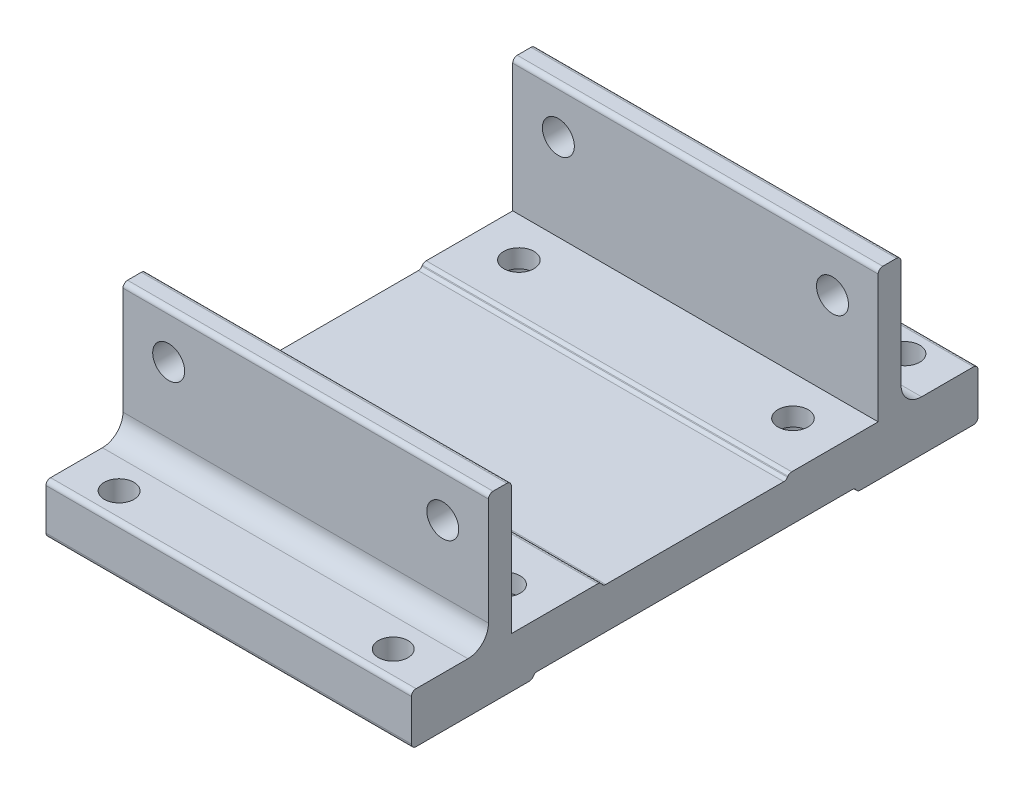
ISO-10303-21;
HEADER;
FILE_DESCRIPTION(('STEP AP214'),'2;1');
FILE_NAME('part.step','',(''),(''),'','','');
FILE_SCHEMA(('AUTOMOTIVE_DESIGN { 1 0 10303 214 1 1 1 1 }'));
ENDSEC;
DATA;
#1=APPLICATION_CONTEXT('core data for automotive mechanical design processes');
#2=APPLICATION_PROTOCOL_DEFINITION('international standard','automotive_design',2000,#1);
#3=PRODUCT_CONTEXT('',#1,'mechanical');
#4=PRODUCT('Part','Part','',(#3));
#5=PRODUCT_RELATED_PRODUCT_CATEGORY('part','',(#4));
#6=PRODUCT_DEFINITION_FORMATION('','',#4);
#7=PRODUCT_DEFINITION_CONTEXT('part definition',#1,'design');
#8=PRODUCT_DEFINITION('design','',#6,#7);
#9=PRODUCT_DEFINITION_SHAPE('','',#8);
#10=(LENGTH_UNIT() NAMED_UNIT(*) SI_UNIT(.MILLI.,.METRE.));
#11=(NAMED_UNIT(*) PLANE_ANGLE_UNIT() SI_UNIT($,.RADIAN.));
#12=(NAMED_UNIT(*) SI_UNIT($,.STERADIAN.) SOLID_ANGLE_UNIT());
#13=UNCERTAINTY_MEASURE_WITH_UNIT(LENGTH_MEASURE(1.E-05),#10,'distance_accuracy_value','');
#14=(GEOMETRIC_REPRESENTATION_CONTEXT(3) GLOBAL_UNCERTAINTY_ASSIGNED_CONTEXT((#13)) GLOBAL_UNIT_ASSIGNED_CONTEXT((#10,
#11,#12)) REPRESENTATION_CONTEXT('',''));
#15=CARTESIAN_POINT('',(0.,0.,0.));
#16=DIRECTION('',(0.,0.,1.));
#17=DIRECTION('',(1.,0.,0.));
#18=AXIS2_PLACEMENT_3D('',#15,#16,#17);
#19=CARTESIAN_POINT('',(80.,9.99999999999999,-20.7002075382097));
#20=DIRECTION('',(0.,-0.573576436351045,-0.819152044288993));
#21=DIRECTION('',(0.,0.819152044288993,-0.573576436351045));
#22=AXIS2_PLACEMENT_3D('',#19,#20,#21);
#23=PLANE('',#22);
#24=DIRECTION('',(1.,0.,0.));
#25=VECTOR('',#24,1.);
#26=CARTESIAN_POINT('',(80.,9.42642356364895,-20.2985849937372));
#27=LINE('',#26,#25);
#28=CARTESIAN_POINT('',(0.,9.42642356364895,-20.2985849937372));
#29=VERTEX_POINT('',#28);
#30=CARTESIAN_POINT('',(80.,9.42642356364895,-20.2985849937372));
#31=VERTEX_POINT('',#30);
#32=EDGE_CURVE('E397',#29,#31,#27,.T.);
#33=ORIENTED_EDGE('',*,*,#32,.T.);
#34=DIRECTION('',(0.,0.819152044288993,-0.573576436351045));
#35=VECTOR('',#34,1.);
#36=CARTESIAN_POINT('',(80.,9.99999999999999,-20.7002075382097));
#37=LINE('',#36,#35);
#38=CARTESIAN_POINT('',(80.,9.57357643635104,-20.4016225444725));
#39=VERTEX_POINT('',#38);
#40=EDGE_CURVE('E402',#39,#31,#37,.F.);
#41=ORIENTED_EDGE('',*,*,#40,.F.);
#42=DIRECTION('',(-1.,0.,0.));
#43=VECTOR('',#42,1.);
#44=CARTESIAN_POINT('',(80.,9.57357643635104,-20.4016225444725));
#45=LINE('',#44,#43);
#46=CARTESIAN_POINT('',(0.,9.57357643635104,-20.4016225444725));
#47=VERTEX_POINT('',#46);
#48=EDGE_CURVE('E410',#47,#39,#45,.F.);
#49=ORIENTED_EDGE('',*,*,#48,.F.);
#50=DIRECTION('',(0.,0.819152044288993,-0.573576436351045));
#51=VECTOR('',#50,1.);
#52=CARTESIAN_POINT('',(0.,9.99999999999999,-20.7002075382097));
#53=LINE('',#52,#51);
#54=EDGE_CURVE('E394',#29,#47,#53,.T.);
#55=ORIENTED_EDGE('',*,*,#54,.F.);
#56=EDGE_LOOP('',(#33,#41,#49,#55));
#57=FACE_BOUND('',#56,.T.);
#58=ADVANCED_FACE('F16',(#57),#23,.F.);
#59=CARTESIAN_POINT('',(80.,9.99999999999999,20.7002075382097));
#60=DIRECTION('',(0.,-0.573576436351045,0.819152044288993));
#61=DIRECTION('',(0.,-0.819152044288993,-0.573576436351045));
#62=AXIS2_PLACEMENT_3D('',#59,#60,#61);
#63=PLANE('',#62);
#64=DIRECTION('',(1.,0.,0.));
#65=VECTOR('',#64,1.);
#66=CARTESIAN_POINT('',(80.,9.42642356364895,20.2985849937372));
#67=LINE('',#66,#65);
#68=CARTESIAN_POINT('',(80.,9.42642356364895,20.2985849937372));
#69=VERTEX_POINT('',#68);
#70=CARTESIAN_POINT('',(0.,9.42642356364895,20.2985849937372));
#71=VERTEX_POINT('',#70);
#72=EDGE_CURVE('E406',#69,#71,#67,.F.);
#73=ORIENTED_EDGE('',*,*,#72,.T.);
#74=DIRECTION('',(0.,-0.819152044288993,-0.573576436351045));
#75=VECTOR('',#74,1.);
#76=CARTESIAN_POINT('',(0.,9.99999999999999,20.7002075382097));
#77=LINE('',#76,#75);
#78=CARTESIAN_POINT('',(0.,9.57357643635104,20.4016225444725));
#79=VERTEX_POINT('',#78);
#80=EDGE_CURVE('E392',#79,#71,#77,.T.);
#81=ORIENTED_EDGE('',*,*,#80,.F.);
#82=DIRECTION('',(-1.,0.,0.));
#83=VECTOR('',#82,1.);
#84=CARTESIAN_POINT('',(80.,9.57357643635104,20.4016225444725));
#85=LINE('',#84,#83);
#86=CARTESIAN_POINT('',(80.,9.57357643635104,20.4016225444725));
#87=VERTEX_POINT('',#86);
#88=EDGE_CURVE('E387',#87,#79,#85,.T.);
#89=ORIENTED_EDGE('',*,*,#88,.F.);
#90=DIRECTION('',(0.,-0.819152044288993,-0.573576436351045));
#91=VECTOR('',#90,1.);
#92=CARTESIAN_POINT('',(80.,9.99999999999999,20.7002075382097));
#93=LINE('',#92,#91);
#94=EDGE_CURVE('E364',#69,#87,#93,.F.);
#95=ORIENTED_EDGE('',*,*,#94,.F.);
#96=EDGE_LOOP('',(#73,#81,#89,#95));
#97=FACE_BOUND('',#96,.T.);
#98=ADVANCED_FACE('F1269',(#97),#63,.F.);
#99=CARTESIAN_POINT('',(80.,0.,-36.2207745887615));
#100=DIRECTION('',(-1.,0.,0.));
#101=DIRECTION('',(0.,0.,1.));
#102=AXIS2_PLACEMENT_3D('',#99,#100,#101);
#103=CYLINDRICAL_SURFACE('',#102,1.);
#104=CARTESIAN_POINT('',(80.,0.,-36.2207745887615));
#105=DIRECTION('',(-1.,0.,0.));
#106=DIRECTION('',(0.,0.,1.));
#107=AXIS2_PLACEMENT_3D('',#104,#105,#106);
#108=CIRCLE('',#107,1.);
#109=CARTESIAN_POINT('',(80.,-1.00000000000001,-36.2207745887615));
#110=VERTEX_POINT('',#109);
#111=CARTESIAN_POINT('',(80.,-0.57357643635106,-35.4016225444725));
#112=VERTEX_POINT('',#111);
#113=EDGE_CURVE('E363',#110,#112,#108,.T.);
#114=ORIENTED_EDGE('',*,*,#113,.T.);
#115=DIRECTION('',(1.,0.,0.));
#116=VECTOR('',#115,1.);
#117=CARTESIAN_POINT('',(80.,-0.573576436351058,-35.4016225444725));
#118=LINE('',#117,#116);
#119=CARTESIAN_POINT('',(73.8765115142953,-0.57357643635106,-35.4016225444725));
#120=VERTEX_POINT('',#119);
#121=EDGE_CURVE('E368',#112,#120,#118,.F.);
#122=ORIENTED_EDGE('',*,*,#121,.T.);
#123=CARTESIAN_POINT('',(73.8765115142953,-0.573576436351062,-35.4016225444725));
#124=CARTESIAN_POINT('',(73.8587577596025,-0.598770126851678,-35.419265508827));
#125=CARTESIAN_POINT('',(73.8399638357,-0.622619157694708,-35.4376940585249));
#126=CARTESIAN_POINT('',(73.8005799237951,-0.667650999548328,-35.4757180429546));
#127=CARTESIAN_POINT('',(73.7799938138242,-0.688839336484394,-35.4953109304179));
#128=CARTESIAN_POINT('',(73.7164386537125,-0.748052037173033,-35.5548009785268));
#129=CARTESIAN_POINT('',(73.6711728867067,-0.782408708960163,-35.5959126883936));
#130=CARTESIAN_POINT('',(73.5578822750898,-0.853660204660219,-35.695126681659));
#131=CARTESIAN_POINT('',(73.4877790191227,-0.88649073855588,-35.7537077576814));
#132=CARTESIAN_POINT('',(73.3411172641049,-0.938593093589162,-35.8698748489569));
#133=CARTESIAN_POINT('',(73.2645072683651,-0.957742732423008,-35.9274475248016));
#134=CARTESIAN_POINT('',(73.1268222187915,-0.981656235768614,-36.0252884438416));
#135=CARTESIAN_POINT('',(73.0666443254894,-0.988818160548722,-36.066288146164));
#136=CARTESIAN_POINT('',(72.9452279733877,-0.997942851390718,-36.1455190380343));
#137=CARTESIAN_POINT('',(72.8840138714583,-0.999972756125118,-36.1837795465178));
#138=CARTESIAN_POINT('',(72.8221068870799,-1.00000000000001,-36.2207745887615));
#139=B_SPLINE_CURVE_WITH_KNOTS('',3,(#123,#124,#125,#126,#127,#128,#129,#130,#131,#132,#133,
#134,#135,#136,#137,#138),.UNSPECIFIED.,.F.,.F.,(4,2,2,2,2,2,2,4),(0.,0.10642224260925,
0.212619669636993,0.422101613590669,0.711785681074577,1.0040255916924,1.223298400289,
1.4396874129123),.UNSPECIFIED.);
#140=CARTESIAN_POINT('',(72.8221068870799,-1.00000000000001,-36.2207745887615));
#141=VERTEX_POINT('',#140);
#142=EDGE_CURVE('E19',#120,#141,#139,.T.);
#143=ORIENTED_EDGE('',*,*,#142,.T.);
#144=DIRECTION('',(1.,0.,0.));
#145=VECTOR('',#144,1.);
#146=CARTESIAN_POINT('',(80.,-1.00000000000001,-36.2207745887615));
#147=LINE('',#146,#145);
#148=EDGE_CURVE('E770',#141,#110,#147,.T.);
#149=ORIENTED_EDGE('',*,*,#148,.T.);
#150=EDGE_LOOP('',(#114,#122,#143,#149));
#151=FACE_BOUND('',#150,.T.);
#152=ADVANCED_FACE('F375',(#151),#103,.T.);
#153=CARTESIAN_POINT('',(80.,0.,-36.2207745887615));
#154=DIRECTION('',(-1.,0.,0.));
#155=DIRECTION('',(0.,0.,1.));
#156=AXIS2_PLACEMENT_3D('',#153,#154,#155);
#157=CYLINDRICAL_SURFACE('',#156,1.);
#158=CARTESIAN_POINT('',(0.,0.,-36.2207745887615));
#159=DIRECTION('',(-1.,0.,0.));
#160=DIRECTION('',(0.,0.,1.));
#161=AXIS2_PLACEMENT_3D('',#158,#159,#160);
#162=CIRCLE('',#161,1.);
#163=CARTESIAN_POINT('',(0.,-0.573576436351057,-35.4016225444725));
#164=VERTEX_POINT('',#163);
#165=CARTESIAN_POINT('',(0.,-1.00000000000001,-36.2207745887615));
#166=VERTEX_POINT('',#165);
#167=EDGE_CURVE('E919',#164,#166,#162,.F.);
#168=ORIENTED_EDGE('',*,*,#167,.T.);
#169=DIRECTION('',(1.,0.,0.));
#170=VECTOR('',#169,1.);
#171=CARTESIAN_POINT('',(80.,-1.00000000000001,-36.2207745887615));
#172=LINE('',#171,#170);
#173=CARTESIAN_POINT('',(7.17789311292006,-1.00000000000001,-36.2207745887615));
#174=VERTEX_POINT('',#173);
#175=EDGE_CURVE('E766',#166,#174,#172,.T.);
#176=ORIENTED_EDGE('',*,*,#175,.T.);
#177=CARTESIAN_POINT('',(7.17789311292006,-1.00000000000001,-36.2207745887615));
#178=CARTESIAN_POINT('',(7.11519917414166,-0.999971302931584,-36.1833125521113));
#179=CARTESIAN_POINT('',(7.05320116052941,-0.997889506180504,-36.144538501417));
#180=CARTESIAN_POINT('',(6.93069369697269,-0.988549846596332,-36.0645048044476));
#181=CARTESIAN_POINT('',(6.87019590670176,-0.981259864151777,-36.0232311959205));
#182=CARTESIAN_POINT('',(6.74992785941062,-0.96011809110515,-35.9376383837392));
#183=CARTESIAN_POINT('',(6.69022464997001,-0.946089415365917,-35.8932663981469));
#184=CARTESIAN_POINT('',(6.57430304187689,-0.910054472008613,-35.8034808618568));
#185=CARTESIAN_POINT('',(6.51807505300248,-0.888071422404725,-35.7580706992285));
#186=CARTESIAN_POINT('',(6.41277225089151,-0.8359449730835,-35.6696865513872));
#187=CARTESIAN_POINT('',(6.36348070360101,-0.806262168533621,-35.6267038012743));
#188=CARTESIAN_POINT('',(6.2707330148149,-0.737300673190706,-35.5430693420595));
#189=CARTESIAN_POINT('',(6.22722364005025,-0.698120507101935,-35.5023986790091));
#190=CARTESIAN_POINT('',(6.17612696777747,-0.641241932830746,-35.4532574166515));
#191=CARTESIAN_POINT('',(6.1651789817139,-0.628319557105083,-35.4426350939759));
#192=CARTESIAN_POINT('',(6.14387164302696,-0.601600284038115,-35.4217973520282));
#193=CARTESIAN_POINT('',(6.1335141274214,-0.587800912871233,-35.4115832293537));
#194=CARTESIAN_POINT('',(6.12348848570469,-0.573576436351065,-35.4016225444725));
#195=B_SPLINE_CURVE_WITH_KNOTS('',3,(#177,#178,#179,#180,#181,#182,#183,#184,#185,#186,#187,
#188,#189,#190,#191,#192,#193,#194),.UNSPECIFIED.,.F.,.F.,(4,2,2,2,2,2,2,2,4),(0.,
0.219173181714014,0.439709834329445,0.666381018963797,0.892395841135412,1.10716187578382,
1.31978873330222,1.37973961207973,1.43986782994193),.UNSPECIFIED.);
#196=CARTESIAN_POINT('',(6.12348848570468,-0.57357643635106,-35.4016225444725));
#197=VERTEX_POINT('',#196);
#198=EDGE_CURVE('E915',#174,#197,#195,.T.);
#199=ORIENTED_EDGE('',*,*,#198,.T.);
#200=DIRECTION('',(1.,0.,0.));
#201=VECTOR('',#200,1.);
#202=CARTESIAN_POINT('',(80.,-0.573576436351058,-35.4016225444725));
#203=LINE('',#202,#201);
#204=EDGE_CURVE('E779',#197,#164,#203,.F.);
#205=ORIENTED_EDGE('',*,*,#204,.T.);
#206=EDGE_LOOP('',(#168,#176,#199,#205));
#207=FACE_BOUND('',#206,.T.);
#208=ADVANCED_FACE('F907',(#207),#157,.T.);
#209=CARTESIAN_POINT('',(80.,0.,-36.2207745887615));
#210=DIRECTION('',(-1.,0.,0.));
#211=DIRECTION('',(0.,0.,1.));
#212=AXIS2_PLACEMENT_3D('',#209,#210,#211);
#213=CYLINDRICAL_SURFACE('',#212,1.);
#214=CARTESIAN_POINT('',(67.17789311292,-1.00000000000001,-36.2207745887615));
#215=CARTESIAN_POINT('',(67.1151991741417,-0.999971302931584,-36.1833125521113));
#216=CARTESIAN_POINT('',(67.0532011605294,-0.997889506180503,-36.144538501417));
#217=CARTESIAN_POINT('',(66.9306936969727,-0.98854984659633,-36.0645048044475));
#218=CARTESIAN_POINT('',(66.8701959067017,-0.981259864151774,-36.0232311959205));
#219=CARTESIAN_POINT('',(66.7499278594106,-0.960118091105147,-35.9376383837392));
#220=CARTESIAN_POINT('',(66.69022464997,-0.946089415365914,-35.8932663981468));
#221=CARTESIAN_POINT('',(66.5743030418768,-0.910054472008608,-35.8034808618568));
#222=CARTESIAN_POINT('',(66.5180750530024,-0.888071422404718,-35.7580706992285));
#223=CARTESIAN_POINT('',(66.4127722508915,-0.835944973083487,-35.6696865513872));
#224=CARTESIAN_POINT('',(66.363480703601,-0.806262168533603,-35.6267038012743));
#225=CARTESIAN_POINT('',(66.2707330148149,-0.737300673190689,-35.5430693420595));
#226=CARTESIAN_POINT('',(66.2272236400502,-0.698120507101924,-35.5023986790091));
#227=CARTESIAN_POINT('',(66.1761269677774,-0.641241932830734,-35.4532574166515));
#228=CARTESIAN_POINT('',(66.1651789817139,-0.628319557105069,-35.4426350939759));
#229=CARTESIAN_POINT('',(66.1438716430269,-0.6016002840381,-35.4217973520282));
#230=CARTESIAN_POINT('',(66.1335141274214,-0.587800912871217,-35.4115832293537));
#231=CARTESIAN_POINT('',(66.1234884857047,-0.573576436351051,-35.4016225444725));
#232=B_SPLINE_CURVE_WITH_KNOTS('',3,(#214,#215,#216,#217,#218,#219,#220,#221,#222,#223,#224,
#225,#226,#227,#228,#229,#230,#231),.UNSPECIFIED.,.F.,.F.,(4,2,2,2,2,2,2,2,4),(0.,
0.219173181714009,0.439709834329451,0.666381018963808,0.892395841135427,1.10716187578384,
1.31978873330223,1.37973961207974,1.43986782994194),.UNSPECIFIED.);
#233=CARTESIAN_POINT('',(67.17789311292,-1.00000000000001,-36.2207745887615));
#234=VERTEX_POINT('',#233);
#235=CARTESIAN_POINT('',(66.1234884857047,-0.573576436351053,-35.4016225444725));
#236=VERTEX_POINT('',#235);
#237=EDGE_CURVE('E890',#234,#236,#232,.T.);
#238=ORIENTED_EDGE('',*,*,#237,.T.);
#239=DIRECTION('',(1.,0.,0.));
#240=VECTOR('',#239,1.);
#241=CARTESIAN_POINT('',(80.,-0.573576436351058,-35.4016225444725));
#242=LINE('',#241,#240);
#243=CARTESIAN_POINT('',(13.8765115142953,-0.573576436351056,-35.4016225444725));
#244=VERTEX_POINT('',#243);
#245=EDGE_CURVE('E383',#236,#244,#242,.F.);
#246=ORIENTED_EDGE('',*,*,#245,.T.);
#247=CARTESIAN_POINT('',(13.8765115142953,-0.573576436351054,-35.4016225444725));
#248=CARTESIAN_POINT('',(13.8587577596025,-0.598770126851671,-35.419265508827));
#249=CARTESIAN_POINT('',(13.8399638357,-0.6226191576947,-35.4376940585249));
#250=CARTESIAN_POINT('',(13.8005799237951,-0.667650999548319,-35.4757180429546));
#251=CARTESIAN_POINT('',(13.7799938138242,-0.688839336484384,-35.4953109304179));
#252=CARTESIAN_POINT('',(13.7164386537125,-0.748052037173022,-35.5548009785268));
#253=CARTESIAN_POINT('',(13.6711728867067,-0.782408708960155,-35.5959126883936));
#254=CARTESIAN_POINT('',(13.5578822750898,-0.853660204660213,-35.6951266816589));
#255=CARTESIAN_POINT('',(13.4877790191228,-0.886490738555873,-35.7537077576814));
#256=CARTESIAN_POINT('',(13.3411172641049,-0.938593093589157,-35.8698748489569));
#257=CARTESIAN_POINT('',(13.2645072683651,-0.957742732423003,-35.9274475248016));
#258=CARTESIAN_POINT('',(13.1268222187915,-0.981656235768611,-36.0252884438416));
#259=CARTESIAN_POINT('',(13.0666443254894,-0.98881816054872,-36.066288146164));
#260=CARTESIAN_POINT('',(12.9452279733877,-0.997942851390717,-36.1455190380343));
#261=CARTESIAN_POINT('',(12.8840138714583,-0.999972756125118,-36.1837795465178));
#262=CARTESIAN_POINT('',(12.8221068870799,-1.00000000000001,-36.2207745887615));
#263=B_SPLINE_CURVE_WITH_KNOTS('',3,(#247,#248,#249,#250,#251,#252,#253,#254,#255,#256,#257,
#258,#259,#260,#261,#262),.UNSPECIFIED.,.F.,.F.,(4,2,2,2,2,2,2,4),(0.,0.106422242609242,
0.212619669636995,0.422101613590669,0.711785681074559,1.00402559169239,1.223298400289,
1.43968741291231),.UNSPECIFIED.);
#264=CARTESIAN_POINT('',(12.8221068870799,-1.00000000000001,-36.2207745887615));
#265=VERTEX_POINT('',#264);
#266=EDGE_CURVE('E896',#244,#265,#263,.T.);
#267=ORIENTED_EDGE('',*,*,#266,.T.);
#268=DIRECTION('',(1.,0.,0.));
#269=VECTOR('',#268,1.);
#270=CARTESIAN_POINT('',(80.,-1.00000000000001,-36.2207745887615));
#271=LINE('',#270,#269);
#272=EDGE_CURVE('E763',#265,#234,#271,.T.);
#273=ORIENTED_EDGE('',*,*,#272,.T.);
#274=EDGE_LOOP('',(#238,#246,#267,#273));
#275=FACE_BOUND('',#274,.T.);
#276=ADVANCED_FACE('F901',(#275),#213,.T.);
#277=CARTESIAN_POINT('',(80.,0.,-61.));
#278=DIRECTION('',(-1.,0.,0.));
#279=DIRECTION('',(0.,0.,1.));
#280=AXIS2_PLACEMENT_3D('',#277,#278,#279);
#281=CYLINDRICAL_SURFACE('',#280,1.);
#282=CARTESIAN_POINT('',(0.,0.,-61.));
#283=DIRECTION('',(-1.,0.,0.));
#284=DIRECTION('',(0.,0.,1.));
#285=AXIS2_PLACEMENT_3D('',#282,#283,#284);
#286=CIRCLE('',#285,1.);
#287=CARTESIAN_POINT('',(0.,-1.00000000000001,-61.));
#288=VERTEX_POINT('',#287);
#289=CARTESIAN_POINT('',(0.,0.,-62.));
#290=VERTEX_POINT('',#289);
#291=EDGE_CURVE('E887',#288,#290,#286,.F.);
#292=ORIENTED_EDGE('',*,*,#291,.T.);
#293=DIRECTION('',(1.,0.,0.));
#294=VECTOR('',#293,1.);
#295=CARTESIAN_POINT('',(80.,0.,-62.));
#296=LINE('',#295,#294);
#297=CARTESIAN_POINT('',(80.,0.,-62.));
#298=VERTEX_POINT('',#297);
#299=EDGE_CURVE('E757',#290,#298,#296,.T.);
#300=ORIENTED_EDGE('',*,*,#299,.T.);
#301=CARTESIAN_POINT('',(80.,0.,-61.));
#302=DIRECTION('',(-1.,0.,0.));
#303=DIRECTION('',(0.,0.,1.));
#304=AXIS2_PLACEMENT_3D('',#301,#302,#303);
#305=CIRCLE('',#304,1.);
#306=CARTESIAN_POINT('',(80.,-1.00000000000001,-61.));
#307=VERTEX_POINT('',#306);
#308=EDGE_CURVE('E889',#298,#307,#305,.T.);
#309=ORIENTED_EDGE('',*,*,#308,.T.);
#310=DIRECTION('',(1.,0.,0.));
#311=VECTOR('',#310,1.);
#312=CARTESIAN_POINT('',(80.,-1.00000000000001,-61.));
#313=LINE('',#312,#311);
#314=EDGE_CURVE('E769',#307,#288,#313,.F.);
#315=ORIENTED_EDGE('',*,*,#314,.T.);
#316=EDGE_LOOP('',(#292,#300,#309,#315));
#317=FACE_BOUND('',#316,.T.);
#318=ADVANCED_FACE('F906',(#317),#281,.T.);
#319=CARTESIAN_POINT('',(10.,9.99999999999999,-56.));
#320=DIRECTION('',(0.,1.,0.));
#321=DIRECTION('',(0.,0.,1.));
#322=AXIS2_PLACEMENT_3D('',#319,#320,#321);
#323=CYLINDRICAL_SURFACE('',#322,3.25);
#324=CARTESIAN_POINT('',(10.,-1.00000000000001,-56.));
#325=DIRECTION('',(0.,1.,0.));
#326=DIRECTION('',(0.,0.,1.));
#327=AXIS2_PLACEMENT_3D('',#324,#325,#326);
#328=CIRCLE('',#327,3.25);
#329=CARTESIAN_POINT('',(10.,-1.00000000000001,-52.75));
#330=VERTEX_POINT('',#329);
#331=EDGE_CURVE('E782',#330,#330,#328,.F.);
#332=ORIENTED_EDGE('',*,*,#331,.T.);
#333=EDGE_LOOP('',(#332));
#334=FACE_BOUND('',#333,.T.);
#335=CARTESIAN_POINT('',(10.,9.99999999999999,-56.));
#336=DIRECTION('',(0.,1.,0.));
#337=DIRECTION('',(0.,0.,1.));
#338=AXIS2_PLACEMENT_3D('',#335,#336,#337);
#339=CIRCLE('',#338,3.25);
#340=CARTESIAN_POINT('',(10.,9.99999999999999,-52.75));
#341=VERTEX_POINT('',#340);
#342=EDGE_CURVE('E756',#341,#341,#339,.T.);
#343=ORIENTED_EDGE('',*,*,#342,.T.);
#344=EDGE_LOOP('',(#343));
#345=FACE_BOUND('',#344,.T.);
#346=ADVANCED_FACE('F1106',(#334,#345),#323,.F.);
#347=CARTESIAN_POINT('',(80.,8.99999999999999,-61.));
#348=DIRECTION('',(-1.,0.,0.));
#349=DIRECTION('',(0.,0.,1.));
#350=AXIS2_PLACEMENT_3D('',#347,#348,#349);
#351=CYLINDRICAL_SURFACE('',#350,1.);
#352=CARTESIAN_POINT('',(0.,8.99999999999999,-61.));
#353=DIRECTION('',(-1.,0.,0.));
#354=DIRECTION('',(0.,0.,1.));
#355=AXIS2_PLACEMENT_3D('',#352,#353,#354);
#356=CIRCLE('',#355,1.);
#357=CARTESIAN_POINT('',(0.,8.99999999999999,-62.));
#358=VERTEX_POINT('',#357);
#359=CARTESIAN_POINT('',(0.,9.99999999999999,-61.));
#360=VERTEX_POINT('',#359);
#361=EDGE_CURVE('E883',#358,#360,#356,.F.);
#362=ORIENTED_EDGE('',*,*,#361,.T.);
#363=DIRECTION('',(1.,0.,0.));
#364=VECTOR('',#363,1.);
#365=CARTESIAN_POINT('',(80.,9.99999999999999,-61.));
#366=LINE('',#365,#364);
#367=CARTESIAN_POINT('',(80.,9.99999999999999,-61.));
#368=VERTEX_POINT('',#367);
#369=EDGE_CURVE('E753',#360,#368,#366,.T.);
#370=ORIENTED_EDGE('',*,*,#369,.T.);
#371=CARTESIAN_POINT('',(80.,8.99999999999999,-61.));
#372=DIRECTION('',(-1.,0.,0.));
#373=DIRECTION('',(0.,0.,1.));
#374=AXIS2_PLACEMENT_3D('',#371,#372,#373);
#375=CIRCLE('',#374,1.);
#376=CARTESIAN_POINT('',(80.,8.99999999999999,-62.));
#377=VERTEX_POINT('',#376);
#378=EDGE_CURVE('E885',#368,#377,#375,.T.);
#379=ORIENTED_EDGE('',*,*,#378,.T.);
#380=DIRECTION('',(1.,0.,0.));
#381=VECTOR('',#380,1.);
#382=CARTESIAN_POINT('',(80.,8.99999999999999,-62.));
#383=LINE('',#382,#381);
#384=EDGE_CURVE('E760',#377,#358,#383,.F.);
#385=ORIENTED_EDGE('',*,*,#384,.T.);
#386=EDGE_LOOP('',(#362,#370,#379,#385));
#387=FACE_BOUND('',#386,.T.);
#388=ADVANCED_FACE('F1243',(#387),#351,.T.);
#389=CARTESIAN_POINT('',(70.,9.99999999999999,-56.));
#390=DIRECTION('',(0.,1.,0.));
#391=DIRECTION('',(0.,0.,1.));
#392=AXIS2_PLACEMENT_3D('',#389,#390,#391);
#393=CYLINDRICAL_SURFACE('',#392,3.25);
#394=CARTESIAN_POINT('',(70.,-1.00000000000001,-56.));
#395=DIRECTION('',(0.,1.,0.));
#396=DIRECTION('',(0.,0.,1.));
#397=AXIS2_PLACEMENT_3D('',#394,#395,#396);
#398=CIRCLE('',#397,3.25);
#399=CARTESIAN_POINT('',(70.,-1.00000000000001,-52.75));
#400=VERTEX_POINT('',#399);
#401=EDGE_CURVE('E772',#400,#400,#398,.F.);
#402=ORIENTED_EDGE('',*,*,#401,.T.);
#403=EDGE_LOOP('',(#402));
#404=FACE_BOUND('',#403,.T.);
#405=CARTESIAN_POINT('',(70.,9.99999999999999,-56.));
#406=DIRECTION('',(0.,1.,0.));
#407=DIRECTION('',(0.,0.,1.));
#408=AXIS2_PLACEMENT_3D('',#405,#406,#407);
#409=CIRCLE('',#408,3.25);
#410=CARTESIAN_POINT('',(70.,9.99999999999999,-52.75));
#411=VERTEX_POINT('',#410);
#412=EDGE_CURVE('E752',#411,#411,#409,.T.);
#413=ORIENTED_EDGE('',*,*,#412,.T.);
#414=EDGE_LOOP('',(#413));
#415=FACE_BOUND('',#414,.T.);
#416=ADVANCED_FACE('F1236',(#404,#415),#393,.F.);
#417=CARTESIAN_POINT('',(80.,38.,-44.15));
#418=DIRECTION('',(-1.,0.,0.));
#419=DIRECTION('',(0.,0.,1.));
#420=AXIS2_PLACEMENT_3D('',#417,#418,#419);
#421=CYLINDRICAL_SURFACE('',#420,1.);
#422=CARTESIAN_POINT('',(0.,38.,-44.15));
#423=DIRECTION('',(-1.,0.,0.));
#424=DIRECTION('',(0.,0.,1.));
#425=AXIS2_PLACEMENT_3D('',#422,#423,#424);
#426=CIRCLE('',#425,1.);
#427=CARTESIAN_POINT('',(0.,38.,-45.15));
#428=VERTEX_POINT('',#427);
#429=CARTESIAN_POINT('',(0.,39.,-44.15));
#430=VERTEX_POINT('',#429);
#431=EDGE_CURVE('E879',#428,#430,#426,.F.);
#432=ORIENTED_EDGE('',*,*,#431,.T.);
#433=DIRECTION('',(1.,0.,0.));
#434=VECTOR('',#433,1.);
#435=CARTESIAN_POINT('',(80.,39.,-44.15));
#436=LINE('',#435,#434);
#437=CARTESIAN_POINT('',(80.,39.,-44.15));
#438=VERTEX_POINT('',#437);
#439=EDGE_CURVE('E734',#430,#438,#436,.T.);
#440=ORIENTED_EDGE('',*,*,#439,.T.);
#441=CARTESIAN_POINT('',(80.,38.,-44.15));
#442=DIRECTION('',(-1.,0.,0.));
#443=DIRECTION('',(0.,0.,1.));
#444=AXIS2_PLACEMENT_3D('',#441,#442,#443);
#445=CIRCLE('',#444,1.);
#446=CARTESIAN_POINT('',(80.,38.,-45.15));
#447=VERTEX_POINT('',#446);
#448=EDGE_CURVE('E881',#438,#447,#445,.T.);
#449=ORIENTED_EDGE('',*,*,#448,.T.);
#450=DIRECTION('',(1.,0.,0.));
#451=VECTOR('',#450,1.);
#452=CARTESIAN_POINT('',(80.,38.,-45.15));
#453=LINE('',#452,#451);
#454=EDGE_CURVE('E741',#447,#428,#453,.F.);
#455=ORIENTED_EDGE('',*,*,#454,.T.);
#456=EDGE_LOOP('',(#432,#440,#449,#455));
#457=FACE_BOUND('',#456,.T.);
#458=ADVANCED_FACE('F1226',(#457),#421,.T.);
#459=CARTESIAN_POINT('',(9.99999999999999,29.,62.));
#460=DIRECTION('',(0.,0.,-1.));
#461=DIRECTION('',(-1.,0.,0.));
#462=AXIS2_PLACEMENT_3D('',#459,#460,#461);
#463=CYLINDRICAL_SURFACE('',#462,3.5);
#464=CARTESIAN_POINT('',(9.99999999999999,29.,-40.15));
#465=DIRECTION('',(0.,0.,-1.));
#466=DIRECTION('',(-1.,0.,0.));
#467=AXIS2_PLACEMENT_3D('',#464,#465,#466);
#468=CIRCLE('',#467,3.5);
#469=CARTESIAN_POINT('',(6.5,29.,-40.15));
#470=VERTEX_POINT('',#469);
#471=EDGE_CURVE('E737',#470,#470,#468,.F.);
#472=ORIENTED_EDGE('',*,*,#471,.T.);
#473=EDGE_LOOP('',(#472));
#474=FACE_BOUND('',#473,.T.);
#475=CARTESIAN_POINT('',(9.99999999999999,29.,-45.15));
#476=DIRECTION('',(0.,0.,-1.));
#477=DIRECTION('',(-1.,0.,0.));
#478=AXIS2_PLACEMENT_3D('',#475,#476,#477);
#479=CIRCLE('',#478,3.5);
#480=CARTESIAN_POINT('',(6.5,29.,-45.15));
#481=VERTEX_POINT('',#480);
#482=EDGE_CURVE('E751',#481,#481,#479,.T.);
#483=ORIENTED_EDGE('',*,*,#482,.T.);
#484=EDGE_LOOP('',(#483));
#485=FACE_BOUND('',#484,.T.);
#486=ADVANCED_FACE('F1223',(#474,#485),#463,.F.);
#487=CARTESIAN_POINT('',(70.,29.,62.));
#488=DIRECTION('',(0.,0.,-1.));
#489=DIRECTION('',(-1.,0.,0.));
#490=AXIS2_PLACEMENT_3D('',#487,#488,#489);
#491=CYLINDRICAL_SURFACE('',#490,3.5);
#492=CARTESIAN_POINT('',(70.,29.,-40.15));
#493=DIRECTION('',(0.,0.,-1.));
#494=DIRECTION('',(-1.,0.,0.));
#495=AXIS2_PLACEMENT_3D('',#492,#493,#494);
#496=CIRCLE('',#495,3.5);
#497=CARTESIAN_POINT('',(66.5,29.,-40.15));
#498=VERTEX_POINT('',#497);
#499=EDGE_CURVE('E733',#498,#498,#496,.F.);
#500=ORIENTED_EDGE('',*,*,#499,.T.);
#501=EDGE_LOOP('',(#500));
#502=FACE_BOUND('',#501,.T.);
#503=CARTESIAN_POINT('',(70.,29.,-45.15));
#504=DIRECTION('',(0.,0.,-1.));
#505=DIRECTION('',(-1.,0.,0.));
#506=AXIS2_PLACEMENT_3D('',#503,#504,#505);
#507=CIRCLE('',#506,3.5);
#508=CARTESIAN_POINT('',(66.5,29.,-45.15));
#509=VERTEX_POINT('',#508);
#510=EDGE_CURVE('E745',#509,#509,#507,.T.);
#511=ORIENTED_EDGE('',*,*,#510,.T.);
#512=EDGE_LOOP('',(#511));
#513=FACE_BOUND('',#512,.T.);
#514=ADVANCED_FACE('F1225',(#502,#513),#491,.F.);
#515=CARTESIAN_POINT('',(80.,38.,-41.15));
#516=DIRECTION('',(-1.,0.,0.));
#517=DIRECTION('',(0.,0.,1.));
#518=AXIS2_PLACEMENT_3D('',#515,#516,#517);
#519=CYLINDRICAL_SURFACE('',#518,1.);
#520=CARTESIAN_POINT('',(0.,38.,-41.15));
#521=DIRECTION('',(-1.,0.,0.));
#522=DIRECTION('',(0.,0.,1.));
#523=AXIS2_PLACEMENT_3D('',#520,#521,#522);
#524=CIRCLE('',#523,1.);
#525=CARTESIAN_POINT('',(0.,39.,-41.15));
#526=VERTEX_POINT('',#525);
#527=CARTESIAN_POINT('',(0.,38.,-40.15));
#528=VERTEX_POINT('',#527);
#529=EDGE_CURVE('E875',#526,#528,#524,.F.);
#530=ORIENTED_EDGE('',*,*,#529,.T.);
#531=DIRECTION('',(1.,0.,0.));
#532=VECTOR('',#531,1.);
#533=CARTESIAN_POINT('',(80.,38.,-40.15));
#534=LINE('',#533,#532);
#535=CARTESIAN_POINT('',(80.,38.,-40.15));
#536=VERTEX_POINT('',#535);
#537=EDGE_CURVE('E729',#528,#536,#534,.T.);
#538=ORIENTED_EDGE('',*,*,#537,.T.);
#539=CARTESIAN_POINT('',(80.,38.,-41.15));
#540=DIRECTION('',(-1.,0.,0.));
#541=DIRECTION('',(0.,0.,1.));
#542=AXIS2_PLACEMENT_3D('',#539,#540,#541);
#543=CIRCLE('',#542,1.);
#544=CARTESIAN_POINT('',(80.,39.,-41.15));
#545=VERTEX_POINT('',#544);
#546=EDGE_CURVE('E877',#536,#545,#543,.T.);
#547=ORIENTED_EDGE('',*,*,#546,.T.);
#548=DIRECTION('',(1.,0.,0.));
#549=VECTOR('',#548,1.);
#550=CARTESIAN_POINT('',(80.,39.,-41.15));
#551=LINE('',#550,#549);
#552=EDGE_CURVE('E738',#545,#526,#551,.F.);
#553=ORIENTED_EDGE('',*,*,#552,.T.);
#554=EDGE_LOOP('',(#530,#538,#547,#553));
#555=FACE_BOUND('',#554,.T.);
#556=ADVANCED_FACE('F1233',(#555),#519,.T.);
#557=CARTESIAN_POINT('',(10.,-1.00000000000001,-31.5));
#558=DIRECTION('',(0.,-1.,0.));
#559=DIRECTION('',(0.,0.,-1.));
#560=AXIS2_PLACEMENT_3D('',#557,#558,#559);
#561=CYLINDRICAL_SURFACE('',#560,3.3);
#562=CARTESIAN_POINT('',(10.,9.99999999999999,-31.5));
#563=DIRECTION('',(0.,-1.,0.));
#564=DIRECTION('',(0.,0.,-1.));
#565=AXIS2_PLACEMENT_3D('',#562,#563,#564);
#566=CIRCLE('',#565,3.3);
#567=CARTESIAN_POINT('',(10.,9.99999999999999,-34.8));
#568=VERTEX_POINT('',#567);
#569=EDGE_CURVE('E732',#568,#568,#566,.F.);
#570=ORIENTED_EDGE('',*,*,#569,.T.);
#571=EDGE_LOOP('',(#570));
#572=FACE_BOUND('',#571,.T.);
#573=CARTESIAN_POINT('',(10.,5.99999999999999,-31.5));
#574=DIRECTION('',(0.,-1.,0.));
#575=DIRECTION('',(0.,0.,-1.));
#576=AXIS2_PLACEMENT_3D('',#573,#574,#575);
#577=CIRCLE('',#576,3.3);
#578=CARTESIAN_POINT('',(10.,5.99999999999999,-34.8));
#579=VERTEX_POINT('',#578);
#580=EDGE_CURVE('E780',#579,#579,#577,.T.);
#581=ORIENTED_EDGE('',*,*,#580,.T.);
#582=EDGE_LOOP('',(#581));
#583=FACE_BOUND('',#582,.T.);
#584=ADVANCED_FACE('F1370',(#572,#583),#561,.F.);
#585=CARTESIAN_POINT('',(70.,-1.00000000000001,-31.5));
#586=DIRECTION('',(0.,-1.,0.));
#587=DIRECTION('',(0.,0.,-1.));
#588=AXIS2_PLACEMENT_3D('',#585,#586,#587);
#589=CYLINDRICAL_SURFACE('',#588,3.29999999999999);
#590=CARTESIAN_POINT('',(70.,9.99999999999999,-31.5));
#591=DIRECTION('',(0.,-1.,0.));
#592=DIRECTION('',(0.,0.,-1.));
#593=AXIS2_PLACEMENT_3D('',#590,#591,#592);
#594=CIRCLE('',#593,3.29999999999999);
#595=CARTESIAN_POINT('',(70.,9.99999999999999,-34.8));
#596=VERTEX_POINT('',#595);
#597=EDGE_CURVE('E726',#596,#596,#594,.F.);
#598=ORIENTED_EDGE('',*,*,#597,.T.);
#599=EDGE_LOOP('',(#598));
#600=FACE_BOUND('',#599,.T.);
#601=CARTESIAN_POINT('',(70.,5.99999999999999,-31.5));
#602=DIRECTION('',(0.,-1.,0.));
#603=DIRECTION('',(0.,0.,-1.));
#604=AXIS2_PLACEMENT_3D('',#601,#602,#603);
#605=CIRCLE('',#604,3.29999999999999);
#606=CARTESIAN_POINT('',(70.,5.99999999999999,-34.8));
#607=VERTEX_POINT('',#606);
#608=EDGE_CURVE('E373',#607,#607,#605,.T.);
#609=ORIENTED_EDGE('',*,*,#608,.T.);
#610=EDGE_LOOP('',(#609));
#611=FACE_BOUND('',#610,.T.);
#612=ADVANCED_FACE('F1378',(#600,#611),#589,.F.);
#613=CARTESIAN_POINT('',(80.,8.99999999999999,-21.2207745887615));
#614=DIRECTION('',(-1.,0.,0.));
#615=DIRECTION('',(0.,0.,1.));
#616=AXIS2_PLACEMENT_3D('',#613,#614,#615);
#617=CYLINDRICAL_SURFACE('',#616,1.);
#618=CARTESIAN_POINT('',(0.,8.99999999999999,-21.2207745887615));
#619=DIRECTION('',(-1.,0.,0.));
#620=DIRECTION('',(0.,0.,1.));
#621=AXIS2_PLACEMENT_3D('',#618,#619,#620);
#622=CIRCLE('',#621,1.);
#623=CARTESIAN_POINT('',(0.,9.99999999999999,-21.2207745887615));
#624=VERTEX_POINT('',#623);
#625=EDGE_CURVE('E413',#624,#47,#622,.F.);
#626=ORIENTED_EDGE('',*,*,#625,.T.);
#627=ORIENTED_EDGE('',*,*,#48,.T.);
#628=CARTESIAN_POINT('',(80.,8.99999999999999,-21.2207745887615));
#629=DIRECTION('',(-1.,0.,0.));
#630=DIRECTION('',(0.,0.,1.));
#631=AXIS2_PLACEMENT_3D('',#628,#629,#630);
#632=CIRCLE('',#631,1.);
#633=CARTESIAN_POINT('',(80.,9.99999999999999,-21.2207745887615));
#634=VERTEX_POINT('',#633);
#635=EDGE_CURVE('E873',#39,#634,#632,.T.);
#636=ORIENTED_EDGE('',*,*,#635,.T.);
#637=DIRECTION('',(1.,0.,0.));
#638=VECTOR('',#637,1.);
#639=CARTESIAN_POINT('',(80.,9.99999999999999,-21.2207745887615));
#640=LINE('',#639,#638);
#641=EDGE_CURVE('E720',#634,#624,#640,.F.);
#642=ORIENTED_EDGE('',*,*,#641,.T.);
#643=EDGE_LOOP('',(#626,#627,#636,#642));
#644=FACE_BOUND('',#643,.T.);
#645=ADVANCED_FACE('F1387',(#644),#617,.T.);
#646=CARTESIAN_POINT('',(80.,9.99999999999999,19.4794329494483));
#647=DIRECTION('',(1.,0.,0.));
#648=DIRECTION('',(0.,0.,-1.));
#649=AXIS2_PLACEMENT_3D('',#646,#647,#648);
#650=CYLINDRICAL_SURFACE('',#649,1.);
#651=DIRECTION('',(1.,0.,0.));
#652=VECTOR('',#651,1.);
#653=CARTESIAN_POINT('',(80.,8.99999999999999,19.4794329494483));
#654=LINE('',#653,#652);
#655=CARTESIAN_POINT('',(80.,8.99999999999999,19.4794329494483));
#656=VERTEX_POINT('',#655);
#657=CARTESIAN_POINT('',(0.,8.99999999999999,19.4794329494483));
#658=VERTEX_POINT('',#657);
#659=EDGE_CURVE('E717',#656,#658,#654,.F.);
#660=ORIENTED_EDGE('',*,*,#659,.T.);
#661=CARTESIAN_POINT('',(0.,9.99999999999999,19.4794329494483));
#662=DIRECTION('',(1.,0.,0.));
#663=DIRECTION('',(0.,0.,-1.));
#664=AXIS2_PLACEMENT_3D('',#661,#662,#663);
#665=CIRCLE('',#664,1.);
#666=EDGE_CURVE('E409',#71,#658,#665,.T.);
#667=ORIENTED_EDGE('',*,*,#666,.F.);
#668=ORIENTED_EDGE('',*,*,#72,.F.);
#669=CARTESIAN_POINT('',(80.,9.99999999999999,19.4794329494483));
#670=DIRECTION('',(1.,0.,0.));
#671=DIRECTION('',(0.,0.,-1.));
#672=AXIS2_PLACEMENT_3D('',#669,#670,#671);
#673=CIRCLE('',#672,1.);
#674=EDGE_CURVE('E868',#656,#69,#673,.F.);
#675=ORIENTED_EDGE('',*,*,#674,.F.);
#676=EDGE_LOOP('',(#660,#667,#668,#675));
#677=FACE_BOUND('',#676,.T.);
#678=ADVANCED_FACE('F1396',(#677),#650,.F.);
#679=CARTESIAN_POINT('',(80.,9.99999999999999,-19.4794329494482));
#680=DIRECTION('',(1.,0.,0.));
#681=DIRECTION('',(0.,0.,-1.));
#682=AXIS2_PLACEMENT_3D('',#679,#680,#681);
#683=CYLINDRICAL_SURFACE('',#682,1.);
#684=ORIENTED_EDGE('',*,*,#32,.F.);
#685=CARTESIAN_POINT('',(0.,9.99999999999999,-19.4794329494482));
#686=DIRECTION('',(1.,0.,0.));
#687=DIRECTION('',(0.,0.,-1.));
#688=AXIS2_PLACEMENT_3D('',#685,#686,#687);
#689=CIRCLE('',#688,1.);
#690=CARTESIAN_POINT('',(0.,8.99999999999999,-19.4794329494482));
#691=VERTEX_POINT('',#690);
#692=EDGE_CURVE('E401',#691,#29,#689,.T.);
#693=ORIENTED_EDGE('',*,*,#692,.F.);
#694=DIRECTION('',(1.,0.,0.));
#695=VECTOR('',#694,1.);
#696=CARTESIAN_POINT('',(80.,8.99999999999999,-19.4794329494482));
#697=LINE('',#696,#695);
#698=CARTESIAN_POINT('',(80.,8.99999999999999,-19.4794329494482));
#699=VERTEX_POINT('',#698);
#700=EDGE_CURVE('E713',#691,#699,#697,.T.);
#701=ORIENTED_EDGE('',*,*,#700,.T.);
#702=CARTESIAN_POINT('',(80.,9.99999999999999,-19.4794329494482));
#703=DIRECTION('',(1.,0.,0.));
#704=DIRECTION('',(0.,0.,-1.));
#705=AXIS2_PLACEMENT_3D('',#702,#703,#704);
#706=CIRCLE('',#705,1.);
#707=EDGE_CURVE('E400',#31,#699,#706,.F.);
#708=ORIENTED_EDGE('',*,*,#707,.F.);
#709=EDGE_LOOP('',(#684,#693,#701,#708));
#710=FACE_BOUND('',#709,.T.);
#711=ADVANCED_FACE('F1405',(#710),#683,.F.);
#712=CARTESIAN_POINT('',(70.,-1.00000000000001,31.5));
#713=DIRECTION('',(0.,-1.,0.));
#714=DIRECTION('',(0.,0.,-1.));
#715=AXIS2_PLACEMENT_3D('',#712,#713,#714);
#716=CYLINDRICAL_SURFACE('',#715,3.29999999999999);
#717=CARTESIAN_POINT('',(70.,9.99999999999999,31.5));
#718=DIRECTION('',(0.,-1.,0.));
#719=DIRECTION('',(0.,0.,-1.));
#720=AXIS2_PLACEMENT_3D('',#717,#718,#719);
#721=CIRCLE('',#720,3.29999999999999);
#722=CARTESIAN_POINT('',(70.,9.99999999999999,28.2));
#723=VERTEX_POINT('',#722);
#724=EDGE_CURVE('E712',#723,#723,#721,.F.);
#725=ORIENTED_EDGE('',*,*,#724,.T.);
#726=EDGE_LOOP('',(#725));
#727=FACE_BOUND('',#726,.T.);
#728=CARTESIAN_POINT('',(70.,5.99999999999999,31.5));
#729=DIRECTION('',(0.,-1.,0.));
#730=DIRECTION('',(0.,0.,-1.));
#731=AXIS2_PLACEMENT_3D('',#728,#729,#730);
#732=CIRCLE('',#731,3.29999999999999);
#733=CARTESIAN_POINT('',(70.,5.99999999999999,28.2));
#734=VERTEX_POINT('',#733);
#735=EDGE_CURVE('E385',#734,#734,#732,.T.);
#736=ORIENTED_EDGE('',*,*,#735,.T.);
#737=EDGE_LOOP('',(#736));
#738=FACE_BOUND('',#737,.T.);
#739=ADVANCED_FACE('F1414',(#727,#738),#716,.F.);
#740=CARTESIAN_POINT('',(80.,8.99999999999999,21.2207745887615));
#741=DIRECTION('',(-1.,0.,0.));
#742=DIRECTION('',(0.,0.,1.));
#743=AXIS2_PLACEMENT_3D('',#740,#741,#742);
#744=CYLINDRICAL_SURFACE('',#743,1.);
#745=CARTESIAN_POINT('',(0.,8.99999999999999,21.2207745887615));
#746=DIRECTION('',(-1.,0.,0.));
#747=DIRECTION('',(0.,0.,1.));
#748=AXIS2_PLACEMENT_3D('',#745,#746,#747);
#749=CIRCLE('',#748,1.);
#750=CARTESIAN_POINT('',(0.,9.99999999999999,21.2207745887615));
#751=VERTEX_POINT('',#750);
#752=EDGE_CURVE('E390',#79,#751,#749,.F.);
#753=ORIENTED_EDGE('',*,*,#752,.T.);
#754=DIRECTION('',(1.,0.,0.));
#755=VECTOR('',#754,1.);
#756=CARTESIAN_POINT('',(80.,9.99999999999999,21.2207745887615));
#757=LINE('',#756,#755);
#758=CARTESIAN_POINT('',(80.,9.99999999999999,21.2207745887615));
#759=VERTEX_POINT('',#758);
#760=EDGE_CURVE('E708',#751,#759,#757,.T.);
#761=ORIENTED_EDGE('',*,*,#760,.T.);
#762=CARTESIAN_POINT('',(80.,8.99999999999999,21.2207745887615));
#763=DIRECTION('',(-1.,0.,0.));
#764=DIRECTION('',(0.,0.,1.));
#765=AXIS2_PLACEMENT_3D('',#762,#763,#764);
#766=CIRCLE('',#765,1.);
#767=EDGE_CURVE('E391',#759,#87,#766,.T.);
#768=ORIENTED_EDGE('',*,*,#767,.T.);
#769=ORIENTED_EDGE('',*,*,#88,.T.);
#770=EDGE_LOOP('',(#753,#761,#768,#769));
#771=FACE_BOUND('',#770,.T.);
#772=ADVANCED_FACE('F1423',(#771),#744,.T.);
#773=CARTESIAN_POINT('',(80.,38.,41.15));
#774=DIRECTION('',(-1.,0.,0.));
#775=DIRECTION('',(0.,0.,1.));
#776=AXIS2_PLACEMENT_3D('',#773,#774,#775);
#777=CYLINDRICAL_SURFACE('',#776,1.);
#778=CARTESIAN_POINT('',(0.,38.,41.15));
#779=DIRECTION('',(-1.,0.,0.));
#780=DIRECTION('',(0.,0.,1.));
#781=AXIS2_PLACEMENT_3D('',#778,#779,#780);
#782=CIRCLE('',#781,1.);
#783=CARTESIAN_POINT('',(0.,38.,40.15));
#784=VERTEX_POINT('',#783);
#785=CARTESIAN_POINT('',(0.,39.,41.15));
#786=VERTEX_POINT('',#785);
#787=EDGE_CURVE('E859',#784,#786,#782,.F.);
#788=ORIENTED_EDGE('',*,*,#787,.T.);
#789=DIRECTION('',(1.,0.,0.));
#790=VECTOR('',#789,1.);
#791=CARTESIAN_POINT('',(80.,39.,41.15));
#792=LINE('',#791,#790);
#793=CARTESIAN_POINT('',(80.,39.,41.15));
#794=VERTEX_POINT('',#793);
#795=EDGE_CURVE('E692',#786,#794,#792,.T.);
#796=ORIENTED_EDGE('',*,*,#795,.T.);
#797=CARTESIAN_POINT('',(80.,38.,41.15));
#798=DIRECTION('',(-1.,0.,0.));
#799=DIRECTION('',(0.,0.,1.));
#800=AXIS2_PLACEMENT_3D('',#797,#798,#799);
#801=CIRCLE('',#800,1.);
#802=CARTESIAN_POINT('',(80.,38.,40.15));
#803=VERTEX_POINT('',#802);
#804=EDGE_CURVE('E861',#794,#803,#801,.T.);
#805=ORIENTED_EDGE('',*,*,#804,.T.);
#806=DIRECTION('',(1.,0.,0.));
#807=VECTOR('',#806,1.);
#808=CARTESIAN_POINT('',(80.,38.,40.15));
#809=LINE('',#808,#807);
#810=EDGE_CURVE('E699',#803,#784,#809,.F.);
#811=ORIENTED_EDGE('',*,*,#810,.T.);
#812=EDGE_LOOP('',(#788,#796,#805,#811));
#813=FACE_BOUND('',#812,.T.);
#814=ADVANCED_FACE('F1432',(#813),#777,.T.);
#815=CARTESIAN_POINT('',(9.99999999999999,29.,62.));
#816=DIRECTION('',(0.,0.,-1.));
#817=DIRECTION('',(-1.,0.,0.));
#818=AXIS2_PLACEMENT_3D('',#815,#816,#817);
#819=CYLINDRICAL_SURFACE('',#818,3.5);
#820=CARTESIAN_POINT('',(9.99999999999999,29.,45.15));
#821=DIRECTION('',(0.,0.,-1.));
#822=DIRECTION('',(-1.,0.,0.));
#823=AXIS2_PLACEMENT_3D('',#820,#821,#822);
#824=CIRCLE('',#823,3.5);
#825=CARTESIAN_POINT('',(6.5,29.,45.15));
#826=VERTEX_POINT('',#825);
#827=EDGE_CURVE('E695',#826,#826,#824,.F.);
#828=ORIENTED_EDGE('',*,*,#827,.T.);
#829=EDGE_LOOP('',(#828));
#830=FACE_BOUND('',#829,.T.);
#831=CARTESIAN_POINT('',(9.99999999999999,29.,40.15));
#832=DIRECTION('',(0.,0.,-1.));
#833=DIRECTION('',(-1.,0.,0.));
#834=AXIS2_PLACEMENT_3D('',#831,#832,#833);
#835=CIRCLE('',#834,3.5);
#836=CARTESIAN_POINT('',(6.5,29.,40.15));
#837=VERTEX_POINT('',#836);
#838=EDGE_CURVE('E711',#837,#837,#835,.T.);
#839=ORIENTED_EDGE('',*,*,#838,.T.);
#840=EDGE_LOOP('',(#839));
#841=FACE_BOUND('',#840,.T.);
#842=ADVANCED_FACE('F1441',(#830,#841),#819,.F.);
#843=CARTESIAN_POINT('',(70.,29.,62.));
#844=DIRECTION('',(0.,0.,-1.));
#845=DIRECTION('',(-1.,0.,0.));
#846=AXIS2_PLACEMENT_3D('',#843,#844,#845);
#847=CYLINDRICAL_SURFACE('',#846,3.5);
#848=CARTESIAN_POINT('',(70.,29.,45.15));
#849=DIRECTION('',(0.,0.,-1.));
#850=DIRECTION('',(-1.,0.,0.));
#851=AXIS2_PLACEMENT_3D('',#848,#849,#850);
#852=CIRCLE('',#851,3.5);
#853=CARTESIAN_POINT('',(66.5,29.,45.15));
#854=VERTEX_POINT('',#853);
#855=EDGE_CURVE('E691',#854,#854,#852,.F.);
#856=ORIENTED_EDGE('',*,*,#855,.T.);
#857=EDGE_LOOP('',(#856));
#858=FACE_BOUND('',#857,.T.);
#859=CARTESIAN_POINT('',(70.,29.,40.15));
#860=DIRECTION('',(0.,0.,-1.));
#861=DIRECTION('',(-1.,0.,0.));
#862=AXIS2_PLACEMENT_3D('',#859,#860,#861);
#863=CIRCLE('',#862,3.5);
#864=CARTESIAN_POINT('',(66.5,29.,40.15));
#865=VERTEX_POINT('',#864);
#866=EDGE_CURVE('E705',#865,#865,#863,.T.);
#867=ORIENTED_EDGE('',*,*,#866,.T.);
#868=EDGE_LOOP('',(#867));
#869=FACE_BOUND('',#868,.T.);
#870=ADVANCED_FACE('F1450',(#858,#869),#847,.F.);
#871=CARTESIAN_POINT('',(80.,38.,44.15));
#872=DIRECTION('',(-1.,0.,0.));
#873=DIRECTION('',(0.,0.,1.));
#874=AXIS2_PLACEMENT_3D('',#871,#872,#873);
#875=CYLINDRICAL_SURFACE('',#874,1.);
#876=CARTESIAN_POINT('',(0.,38.,44.15));
#877=DIRECTION('',(-1.,0.,0.));
#878=DIRECTION('',(0.,0.,1.));
#879=AXIS2_PLACEMENT_3D('',#876,#877,#878);
#880=CIRCLE('',#879,1.);
#881=CARTESIAN_POINT('',(0.,39.,44.15));
#882=VERTEX_POINT('',#881);
#883=CARTESIAN_POINT('',(0.,38.,45.15));
#884=VERTEX_POINT('',#883);
#885=EDGE_CURVE('E855',#882,#884,#880,.F.);
#886=ORIENTED_EDGE('',*,*,#885,.T.);
#887=DIRECTION('',(-1.,0.,0.));
#888=VECTOR('',#887,1.);
#889=CARTESIAN_POINT('',(80.,38.,45.15));
#890=LINE('',#889,#888);
#891=CARTESIAN_POINT('',(80.,38.,45.15));
#892=VERTEX_POINT('',#891);
#893=EDGE_CURVE('E688',#884,#892,#890,.F.);
#894=ORIENTED_EDGE('',*,*,#893,.T.);
#895=CARTESIAN_POINT('',(80.,38.,44.15));
#896=DIRECTION('',(-1.,0.,0.));
#897=DIRECTION('',(0.,0.,1.));
#898=AXIS2_PLACEMENT_3D('',#895,#896,#897);
#899=CIRCLE('',#898,1.);
#900=CARTESIAN_POINT('',(80.,39.,44.15));
#901=VERTEX_POINT('',#900);
#902=EDGE_CURVE('E857',#892,#901,#899,.T.);
#903=ORIENTED_EDGE('',*,*,#902,.T.);
#904=DIRECTION('',(1.,0.,0.));
#905=VECTOR('',#904,1.);
#906=CARTESIAN_POINT('',(80.,39.,44.15));
#907=LINE('',#906,#905);
#908=EDGE_CURVE('E696',#901,#882,#907,.F.);
#909=ORIENTED_EDGE('',*,*,#908,.T.);
#910=EDGE_LOOP('',(#886,#894,#903,#909));
#911=FACE_BOUND('',#910,.T.);
#912=ADVANCED_FACE('F1459',(#911),#875,.T.);
#913=CARTESIAN_POINT('',(80.,8.99999999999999,61.));
#914=DIRECTION('',(-1.,0.,0.));
#915=DIRECTION('',(0.,0.,1.));
#916=AXIS2_PLACEMENT_3D('',#913,#914,#915);
#917=CYLINDRICAL_SURFACE('',#916,1.);
#918=CARTESIAN_POINT('',(0.,8.99999999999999,61.));
#919=DIRECTION('',(-1.,0.,0.));
#920=DIRECTION('',(0.,0.,1.));
#921=AXIS2_PLACEMENT_3D('',#918,#919,#920);
#922=CIRCLE('',#921,1.);
#923=CARTESIAN_POINT('',(0.,9.99999999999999,61.));
#924=VERTEX_POINT('',#923);
#925=CARTESIAN_POINT('',(0.,8.99999999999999,62.));
#926=VERTEX_POINT('',#925);
#927=EDGE_CURVE('E852',#924,#926,#922,.F.);
#928=ORIENTED_EDGE('',*,*,#927,.T.);
#929=DIRECTION('',(-1.,0.,0.));
#930=VECTOR('',#929,1.);
#931=CARTESIAN_POINT('',(80.,8.99999999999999,62.));
#932=LINE('',#931,#930);
#933=CARTESIAN_POINT('',(80.,8.99999999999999,62.));
#934=VERTEX_POINT('',#933);
#935=EDGE_CURVE('E672',#926,#934,#932,.F.);
#936=ORIENTED_EDGE('',*,*,#935,.T.);
#937=CARTESIAN_POINT('',(80.,8.99999999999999,61.));
#938=DIRECTION('',(-1.,0.,0.));
#939=DIRECTION('',(0.,0.,1.));
#940=AXIS2_PLACEMENT_3D('',#937,#938,#939);
#941=CIRCLE('',#940,1.);
#942=CARTESIAN_POINT('',(80.,9.99999999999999,61.));
#943=VERTEX_POINT('',#942);
#944=EDGE_CURVE('E598',#934,#943,#941,.T.);
#945=ORIENTED_EDGE('',*,*,#944,.T.);
#946=DIRECTION('',(1.,0.,0.));
#947=VECTOR('',#946,1.);
#948=CARTESIAN_POINT('',(80.,9.99999999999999,61.));
#949=LINE('',#948,#947);
#950=EDGE_CURVE('E675',#943,#924,#949,.F.);
#951=ORIENTED_EDGE('',*,*,#950,.T.);
#952=EDGE_LOOP('',(#928,#936,#945,#951));
#953=FACE_BOUND('',#952,.T.);
#954=ADVANCED_FACE('F1468',(#953),#917,.T.);
#955=CARTESIAN_POINT('',(70.,9.99999999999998,56.));
#956=DIRECTION('',(0.,1.,0.));
#957=DIRECTION('',(0.,0.,1.));
#958=AXIS2_PLACEMENT_3D('',#955,#956,#957);
#959=CYLINDRICAL_SURFACE('',#958,3.25);
#960=CARTESIAN_POINT('',(70.,-1.00000000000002,56.));
#961=DIRECTION('',(0.,1.,0.));
#962=DIRECTION('',(0.,0.,1.));
#963=AXIS2_PLACEMENT_3D('',#960,#961,#962);
#964=CIRCLE('',#963,3.25);
#965=CARTESIAN_POINT('',(70.,-1.00000000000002,59.25));
#966=VERTEX_POINT('',#965);
#967=EDGE_CURVE('E1070',#966,#966,#964,.F.);
#968=ORIENTED_EDGE('',*,*,#967,.T.);
#969=EDGE_LOOP('',(#968));
#970=FACE_BOUND('',#969,.T.);
#971=CARTESIAN_POINT('',(70.,9.99999999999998,56.));
#972=DIRECTION('',(0.,1.,0.));
#973=DIRECTION('',(0.,0.,1.));
#974=AXIS2_PLACEMENT_3D('',#971,#972,#973);
#975=CIRCLE('',#974,3.25);
#976=CARTESIAN_POINT('',(70.,9.99999999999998,59.25));
#977=VERTEX_POINT('',#976);
#978=EDGE_CURVE('E687',#977,#977,#975,.T.);
#979=ORIENTED_EDGE('',*,*,#978,.T.);
#980=EDGE_LOOP('',(#979));
#981=FACE_BOUND('',#980,.T.);
#982=ADVANCED_FACE('F1477',(#970,#981),#959,.F.);
#983=CARTESIAN_POINT('',(10.,9.99999999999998,56.));
#984=DIRECTION('',(0.,1.,0.));
#985=DIRECTION('',(0.,0.,1.));
#986=AXIS2_PLACEMENT_3D('',#983,#984,#985);
#987=CYLINDRICAL_SURFACE('',#986,3.25);
#988=CARTESIAN_POINT('',(10.,-1.00000000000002,56.));
#989=DIRECTION('',(0.,1.,0.));
#990=DIRECTION('',(0.,0.,1.));
#991=AXIS2_PLACEMENT_3D('',#988,#989,#990);
#992=CIRCLE('',#991,3.25);
#993=CARTESIAN_POINT('',(10.,-1.00000000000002,59.25));
#994=VERTEX_POINT('',#993);
#995=EDGE_CURVE('E671',#994,#994,#992,.F.);
#996=ORIENTED_EDGE('',*,*,#995,.T.);
#997=EDGE_LOOP('',(#996));
#998=FACE_BOUND('',#997,.T.);
#999=CARTESIAN_POINT('',(10.,9.99999999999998,56.));
#1000=DIRECTION('',(0.,1.,0.));
#1001=DIRECTION('',(0.,0.,1.));
#1002=AXIS2_PLACEMENT_3D('',#999,#1000,#1001);
#1003=CIRCLE('',#1002,3.25);
#1004=CARTESIAN_POINT('',(10.,9.99999999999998,59.25));
#1005=VERTEX_POINT('',#1004);
#1006=EDGE_CURVE('E681',#1005,#1005,#1003,.T.);
#1007=ORIENTED_EDGE('',*,*,#1006,.T.);
#1008=EDGE_LOOP('',(#1007));
#1009=FACE_BOUND('',#1008,.T.);
#1010=ADVANCED_FACE('F1486',(#998,#1009),#987,.F.);
#1011=CARTESIAN_POINT('',(80.,0.,61.));
#1012=DIRECTION('',(-1.,0.,0.));
#1013=DIRECTION('',(0.,0.,1.));
#1014=AXIS2_PLACEMENT_3D('',#1011,#1012,#1013);
#1015=CYLINDRICAL_SURFACE('',#1014,1.);
#1016=CARTESIAN_POINT('',(0.,0.,61.));
#1017=DIRECTION('',(-1.,0.,0.));
#1018=DIRECTION('',(0.,0.,1.));
#1019=AXIS2_PLACEMENT_3D('',#1016,#1017,#1018);
#1020=CIRCLE('',#1019,1.);
#1021=CARTESIAN_POINT('',(0.,0.,62.));
#1022=VERTEX_POINT('',#1021);
#1023=CARTESIAN_POINT('',(0.,-1.00000000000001,61.));
#1024=VERTEX_POINT('',#1023);
#1025=EDGE_CURVE('E848',#1022,#1024,#1020,.F.);
#1026=ORIENTED_EDGE('',*,*,#1025,.T.);
#1027=DIRECTION('',(1.,0.,0.));
#1028=VECTOR('',#1027,1.);
#1029=CARTESIAN_POINT('',(80.,-1.00000000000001,61.));
#1030=LINE('',#1029,#1028);
#1031=CARTESIAN_POINT('',(80.,-1.00000000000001,61.));
#1032=VERTEX_POINT('',#1031);
#1033=EDGE_CURVE('E668',#1024,#1032,#1030,.T.);
#1034=ORIENTED_EDGE('',*,*,#1033,.T.);
#1035=CARTESIAN_POINT('',(80.,0.,61.));
#1036=DIRECTION('',(-1.,0.,0.));
#1037=DIRECTION('',(0.,0.,1.));
#1038=AXIS2_PLACEMENT_3D('',#1035,#1036,#1037);
#1039=CIRCLE('',#1038,1.);
#1040=CARTESIAN_POINT('',(80.,0.,62.));
#1041=VERTEX_POINT('',#1040);
#1042=EDGE_CURVE('E850',#1032,#1041,#1039,.T.);
#1043=ORIENTED_EDGE('',*,*,#1042,.T.);
#1044=DIRECTION('',(-1.,0.,0.));
#1045=VECTOR('',#1044,1.);
#1046=CARTESIAN_POINT('',(80.,0.,62.));
#1047=LINE('',#1046,#1045);
#1048=EDGE_CURVE('E674',#1041,#1022,#1047,.T.);
#1049=ORIENTED_EDGE('',*,*,#1048,.T.);
#1050=EDGE_LOOP('',(#1026,#1034,#1043,#1049));
#1051=FACE_BOUND('',#1050,.T.);
#1052=ADVANCED_FACE('F1495',(#1051),#1015,.T.);
#1053=CARTESIAN_POINT('',(80.,0.,36.2207745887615));
#1054=DIRECTION('',(-1.,0.,0.));
#1055=DIRECTION('',(0.,0.,1.));
#1056=AXIS2_PLACEMENT_3D('',#1053,#1054,#1055);
#1057=CYLINDRICAL_SURFACE('',#1056,1.);
#1058=CARTESIAN_POINT('',(80.,0.,36.2207745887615));
#1059=DIRECTION('',(-1.,0.,0.));
#1060=DIRECTION('',(0.,0.,1.));
#1061=AXIS2_PLACEMENT_3D('',#1058,#1059,#1060);
#1062=CIRCLE('',#1061,1.);
#1063=CARTESIAN_POINT('',(80.,-0.573576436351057,35.4016225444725));
#1064=VERTEX_POINT('',#1063);
#1065=CARTESIAN_POINT('',(80.,-1.00000000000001,36.2207745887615));
#1066=VERTEX_POINT('',#1065);
#1067=EDGE_CURVE('E841',#1064,#1066,#1062,.T.);
#1068=ORIENTED_EDGE('',*,*,#1067,.T.);
#1069=DIRECTION('',(1.,0.,0.));
#1070=VECTOR('',#1069,1.);
#1071=CARTESIAN_POINT('',(80.,-1.00000000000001,36.2207745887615));
#1072=LINE('',#1071,#1070);
#1073=CARTESIAN_POINT('',(72.8221068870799,-1.00000000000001,36.2207745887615));
#1074=VERTEX_POINT('',#1073);
#1075=EDGE_CURVE('E665',#1066,#1074,#1072,.F.);
#1076=ORIENTED_EDGE('',*,*,#1075,.T.);
#1077=CARTESIAN_POINT('',(72.8221068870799,-1.00000000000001,36.2207745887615));
#1078=CARTESIAN_POINT('',(72.8848008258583,-0.999971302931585,36.1833125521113));
#1079=CARTESIAN_POINT('',(72.9467988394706,-0.997889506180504,36.144538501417));
#1080=CARTESIAN_POINT('',(73.0693063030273,-0.988549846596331,36.0645048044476));
#1081=CARTESIAN_POINT('',(73.1298040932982,-0.981259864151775,36.0232311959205));
#1082=CARTESIAN_POINT('',(73.2500721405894,-0.960118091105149,35.9376383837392));
#1083=CARTESIAN_POINT('',(73.30977535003,-0.946089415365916,35.8932663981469));
#1084=CARTESIAN_POINT('',(73.4256969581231,-0.910054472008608,35.8034808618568));
#1085=CARTESIAN_POINT('',(73.4819249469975,-0.888071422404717,35.7580706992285));
#1086=CARTESIAN_POINT('',(73.5872277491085,-0.83594497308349,35.6696865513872));
#1087=CARTESIAN_POINT('',(73.636519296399,-0.80626216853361,35.6267038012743));
#1088=CARTESIAN_POINT('',(73.7292669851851,-0.737300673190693,35.5430693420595));
#1089=CARTESIAN_POINT('',(73.7727763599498,-0.698120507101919,35.5023986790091));
#1090=CARTESIAN_POINT('',(73.8238730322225,-0.641241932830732,35.4532574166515));
#1091=CARTESIAN_POINT('',(73.8348210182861,-0.62831955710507,35.4426350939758));
#1092=CARTESIAN_POINT('',(73.856128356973,-0.601600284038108,35.4217973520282));
#1093=CARTESIAN_POINT('',(73.8664858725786,-0.587800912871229,35.4115832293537));
#1094=CARTESIAN_POINT('',(73.8765115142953,-0.573576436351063,35.4016225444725));
#1095=B_SPLINE_CURVE_WITH_KNOTS('',3,(#1077,#1078,#1079,#1080,#1081,#1082,#1083,#1084,#1085,
#1086,#1087,#1088,#1089,#1090,#1091,#1092,#1093,#1094),.UNSPECIFIED.,.F.,.F.,(4,2,2,2,2,2,2,2,
4),(0.,0.219173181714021,0.439709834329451,0.666381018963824,0.892395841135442,1.10716187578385,
1.31978873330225,1.37973961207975,1.43986782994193),.UNSPECIFIED.);
#1096=CARTESIAN_POINT('',(73.8765115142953,-0.573576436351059,35.4016225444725));
#1097=VERTEX_POINT('',#1096);
#1098=EDGE_CURVE('E843',#1074,#1097,#1095,.T.);
#1099=ORIENTED_EDGE('',*,*,#1098,.T.);
#1100=DIRECTION('',(1.,0.,0.));
#1101=VECTOR('',#1100,1.);
#1102=CARTESIAN_POINT('',(80.,-0.573576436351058,35.4016225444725));
#1103=LINE('',#1102,#1101);
#1104=EDGE_CURVE('E376',#1097,#1064,#1103,.T.);
#1105=ORIENTED_EDGE('',*,*,#1104,.T.);
#1106=EDGE_LOOP('',(#1068,#1076,#1099,#1105));
#1107=FACE_BOUND('',#1106,.T.);
#1108=ADVANCED_FACE('F829',(#1107),#1057,.T.);
#1109=CARTESIAN_POINT('',(80.,0.,36.2207745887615));
#1110=DIRECTION('',(-1.,0.,0.));
#1111=DIRECTION('',(0.,0.,1.));
#1112=AXIS2_PLACEMENT_3D('',#1109,#1110,#1111);
#1113=CYLINDRICAL_SURFACE('',#1112,1.);
#1114=CARTESIAN_POINT('',(0.,0.,36.2207745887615));
#1115=DIRECTION('',(-1.,0.,0.));
#1116=DIRECTION('',(0.,0.,1.));
#1117=AXIS2_PLACEMENT_3D('',#1114,#1115,#1116);
#1118=CIRCLE('',#1117,1.);
#1119=CARTESIAN_POINT('',(0.,-1.00000000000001,36.2207745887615));
#1120=VERTEX_POINT('',#1119);
#1121=CARTESIAN_POINT('',(0.,-0.573576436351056,35.4016225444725));
#1122=VERTEX_POINT('',#1121);
#1123=EDGE_CURVE('E840',#1120,#1122,#1118,.F.);
#1124=ORIENTED_EDGE('',*,*,#1123,.T.);
#1125=DIRECTION('',(1.,0.,0.));
#1126=VECTOR('',#1125,1.);
#1127=CARTESIAN_POINT('',(80.,-0.573576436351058,35.4016225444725));
#1128=LINE('',#1127,#1126);
#1129=CARTESIAN_POINT('',(6.12348848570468,-0.573576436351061,35.4016225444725));
#1130=VERTEX_POINT('',#1129);
#1131=EDGE_CURVE('E678',#1122,#1130,#1128,.T.);
#1132=ORIENTED_EDGE('',*,*,#1131,.T.);
#1133=CARTESIAN_POINT('',(6.12348848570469,-0.573576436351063,35.4016225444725));
#1134=CARTESIAN_POINT('',(6.14124224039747,-0.59877012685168,35.419265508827));
#1135=CARTESIAN_POINT('',(6.16003616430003,-0.622619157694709,35.4376940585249));
#1136=CARTESIAN_POINT('',(6.19942007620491,-0.667650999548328,35.4757180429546));
#1137=CARTESIAN_POINT('',(6.22000618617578,-0.688839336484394,35.4953109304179));
#1138=CARTESIAN_POINT('',(6.28356134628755,-0.748052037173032,35.5548009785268));
#1139=CARTESIAN_POINT('',(6.32882711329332,-0.782408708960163,35.5959126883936));
#1140=CARTESIAN_POINT('',(6.44211772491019,-0.853660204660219,35.6951266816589));
#1141=CARTESIAN_POINT('',(6.51222098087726,-0.88649073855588,35.7537077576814));
#1142=CARTESIAN_POINT('',(6.65888273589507,-0.938593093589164,35.8698748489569));
#1143=CARTESIAN_POINT('',(6.73549273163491,-0.957742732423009,35.9274475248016));
#1144=CARTESIAN_POINT('',(6.87317778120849,-0.981656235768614,36.0252884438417));
#1145=CARTESIAN_POINT('',(6.93335567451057,-0.988818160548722,36.066288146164));
#1146=CARTESIAN_POINT('',(7.05477202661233,-0.997942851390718,36.1455190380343));
#1147=CARTESIAN_POINT('',(7.11598612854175,-0.999972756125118,36.1837795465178));
#1148=CARTESIAN_POINT('',(7.17789311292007,-1.00000000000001,36.2207745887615));
#1149=B_SPLINE_CURVE_WITH_KNOTS('',3,(#1133,#1134,#1135,#1136,#1137,#1138,#1139,#1140,#1141,
#1142,#1143,#1144,#1145,#1146,#1147,#1148),.UNSPECIFIED.,.F.,.F.,(4,2,2,2,2,2,2,4),(0.,
0.106422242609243,0.212619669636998,0.422101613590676,0.71178568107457,1.00402559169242,
1.22329840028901,1.4396874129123),.UNSPECIFIED.);
#1150=CARTESIAN_POINT('',(7.17789311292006,-1.00000000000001,36.2207745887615));
#1151=VERTEX_POINT('',#1150);
#1152=EDGE_CURVE('E834',#1130,#1151,#1149,.T.);
#1153=ORIENTED_EDGE('',*,*,#1152,.T.);
#1154=DIRECTION('',(1.,0.,0.));
#1155=VECTOR('',#1154,1.);
#1156=CARTESIAN_POINT('',(80.,-1.00000000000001,36.2207745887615));
#1157=LINE('',#1156,#1155);
#1158=EDGE_CURVE('E660',#1151,#1120,#1157,.F.);
#1159=ORIENTED_EDGE('',*,*,#1158,.T.);
#1160=EDGE_LOOP('',(#1124,#1132,#1153,#1159));
#1161=FACE_BOUND('',#1160,.T.);
#1162=ADVANCED_FACE('F824',(#1161),#1113,.T.);
#1163=CARTESIAN_POINT('',(10.,-1.00000000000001,31.5));
#1164=DIRECTION('',(0.,-1.,0.));
#1165=DIRECTION('',(0.,0.,-1.));
#1166=AXIS2_PLACEMENT_3D('',#1163,#1164,#1165);
#1167=CYLINDRICAL_SURFACE('',#1166,3.29999999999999);
#1168=CARTESIAN_POINT('',(10.,9.99999999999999,31.5));
#1169=DIRECTION('',(0.,-1.,0.));
#1170=DIRECTION('',(0.,0.,-1.));
#1171=AXIS2_PLACEMENT_3D('',#1168,#1169,#1170);
#1172=CIRCLE('',#1171,3.29999999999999);
#1173=CARTESIAN_POINT('',(10.,9.99999999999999,28.2));
#1174=VERTEX_POINT('',#1173);
#1175=EDGE_CURVE('E716',#1174,#1174,#1172,.F.);
#1176=ORIENTED_EDGE('',*,*,#1175,.T.);
#1177=EDGE_LOOP('',(#1176));
#1178=FACE_BOUND('',#1177,.T.);
#1179=CARTESIAN_POINT('',(10.,5.99999999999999,31.5));
#1180=DIRECTION('',(0.,-1.,0.));
#1181=DIRECTION('',(0.,0.,-1.));
#1182=AXIS2_PLACEMENT_3D('',#1179,#1180,#1181);
#1183=CIRCLE('',#1182,3.29999999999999);
#1184=CARTESIAN_POINT('',(10.,5.99999999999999,28.2));
#1185=VERTEX_POINT('',#1184);
#1186=EDGE_CURVE('E659',#1185,#1185,#1183,.T.);
#1187=ORIENTED_EDGE('',*,*,#1186,.T.);
#1188=EDGE_LOOP('',(#1187));
#1189=FACE_BOUND('',#1188,.T.);
#1190=ADVANCED_FACE('F818',(#1178,#1189),#1167,.F.);
#1191=CARTESIAN_POINT('',(80.,0.,36.2207745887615));
#1192=DIRECTION('',(-1.,0.,0.));
#1193=DIRECTION('',(0.,0.,1.));
#1194=AXIS2_PLACEMENT_3D('',#1191,#1192,#1193);
#1195=CYLINDRICAL_SURFACE('',#1194,1.);
#1196=CARTESIAN_POINT('',(66.1234884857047,-0.573576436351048,35.4016225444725));
#1197=CARTESIAN_POINT('',(66.1412422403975,-0.598770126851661,35.419265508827));
#1198=CARTESIAN_POINT('',(66.1600361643,-0.622619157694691,35.4376940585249));
#1199=CARTESIAN_POINT('',(66.1994200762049,-0.667650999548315,35.4757180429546));
#1200=CARTESIAN_POINT('',(66.2200061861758,-0.688839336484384,35.4953109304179));
#1201=CARTESIAN_POINT('',(66.2835613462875,-0.748052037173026,35.5548009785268));
#1202=CARTESIAN_POINT('',(66.3288271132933,-0.782408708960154,35.5959126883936));
#1203=CARTESIAN_POINT('',(66.4421177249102,-0.853660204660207,35.6951266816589));
#1204=CARTESIAN_POINT('',(66.5122209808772,-0.886490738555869,35.7537077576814));
#1205=CARTESIAN_POINT('',(66.658882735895,-0.938593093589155,35.8698748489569));
#1206=CARTESIAN_POINT('',(66.7354927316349,-0.957742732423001,35.9274475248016));
#1207=CARTESIAN_POINT('',(66.8731777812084,-0.981656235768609,36.0252884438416));
#1208=CARTESIAN_POINT('',(66.9333556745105,-0.988818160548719,36.066288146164));
#1209=CARTESIAN_POINT('',(67.0547720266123,-0.997942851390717,36.1455190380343));
#1210=CARTESIAN_POINT('',(67.1159861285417,-0.999972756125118,36.1837795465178));
#1211=CARTESIAN_POINT('',(67.17789311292,-1.00000000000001,36.2207745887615));
#1212=B_SPLINE_CURVE_WITH_KNOTS('',3,(#1196,#1197,#1198,#1199,#1200,#1201,#1202,#1203,#1204,
#1205,#1206,#1207,#1208,#1209,#1210,#1211),.UNSPECIFIED.,.F.,.F.,(4,2,2,2,2,2,2,4),(0.,
0.106422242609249,0.212619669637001,0.422101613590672,0.711785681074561,1.00402559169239,
1.22329840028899,1.43968741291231),.UNSPECIFIED.);
#1213=CARTESIAN_POINT('',(66.1234884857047,-0.573576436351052,35.4016225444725));
#1214=VERTEX_POINT('',#1213);
#1215=CARTESIAN_POINT('',(67.17789311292,-1.00000000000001,36.2207745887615));
#1216=VERTEX_POINT('',#1215);
#1217=EDGE_CURVE('E801',#1214,#1216,#1212,.T.);
#1218=ORIENTED_EDGE('',*,*,#1217,.T.);
#1219=DIRECTION('',(1.,0.,0.));
#1220=VECTOR('',#1219,1.);
#1221=CARTESIAN_POINT('',(80.,-1.00000000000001,36.2207745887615));
#1222=LINE('',#1221,#1220);
#1223=CARTESIAN_POINT('',(12.8221068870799,-1.00000000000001,36.2207745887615));
#1224=VERTEX_POINT('',#1223);
#1225=EDGE_CURVE('E663',#1216,#1224,#1222,.F.);
#1226=ORIENTED_EDGE('',*,*,#1225,.T.);
#1227=CARTESIAN_POINT('',(12.8221068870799,-1.00000000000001,36.2207745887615));
#1228=CARTESIAN_POINT('',(12.8848008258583,-0.999971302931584,36.1833125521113));
#1229=CARTESIAN_POINT('',(12.9467988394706,-0.997889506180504,36.144538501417));
#1230=CARTESIAN_POINT('',(13.0693063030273,-0.988549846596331,36.0645048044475));
#1231=CARTESIAN_POINT('',(13.1298040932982,-0.981259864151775,36.0232311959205));
#1232=CARTESIAN_POINT('',(13.2500721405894,-0.960118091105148,35.9376383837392));
#1233=CARTESIAN_POINT('',(13.30977535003,-0.946089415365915,35.8932663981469));
#1234=CARTESIAN_POINT('',(13.4256969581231,-0.910054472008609,35.8034808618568));
#1235=CARTESIAN_POINT('',(13.4819249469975,-0.888071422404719,35.7580706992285));
#1236=CARTESIAN_POINT('',(13.5872277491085,-0.835944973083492,35.6696865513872));
#1237=CARTESIAN_POINT('',(13.636519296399,-0.806262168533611,35.6267038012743));
#1238=CARTESIAN_POINT('',(13.7292669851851,-0.737300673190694,35.5430693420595));
#1239=CARTESIAN_POINT('',(13.7727763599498,-0.698120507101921,35.5023986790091));
#1240=CARTESIAN_POINT('',(13.8238730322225,-0.641241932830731,35.4532574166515));
#1241=CARTESIAN_POINT('',(13.8348210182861,-0.628319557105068,35.4426350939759));
#1242=CARTESIAN_POINT('',(13.856128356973,-0.6016002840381,35.4217973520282));
#1243=CARTESIAN_POINT('',(13.8664858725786,-0.587800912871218,35.4115832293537));
#1244=CARTESIAN_POINT('',(13.8765115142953,-0.57357643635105,35.4016225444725));
#1245=B_SPLINE_CURVE_WITH_KNOTS('',3,(#1227,#1228,#1229,#1230,#1231,#1232,#1233,#1234,#1235,
#1236,#1237,#1238,#1239,#1240,#1241,#1242,#1243,#1244),.UNSPECIFIED.,.F.,.F.,(4,2,2,2,2,2,2,2,
4),(0.,0.219173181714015,0.439709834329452,0.666381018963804,0.892395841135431,1.10716187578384,
1.31978873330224,1.37973961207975,1.43986782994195),.UNSPECIFIED.);
#1246=CARTESIAN_POINT('',(13.8765115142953,-0.573576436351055,35.4016225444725));
#1247=VERTEX_POINT('',#1246);
#1248=EDGE_CURVE('E465',#1224,#1247,#1245,.T.);
#1249=ORIENTED_EDGE('',*,*,#1248,.T.);
#1250=DIRECTION('',(1.,0.,0.));
#1251=VECTOR('',#1250,1.);
#1252=CARTESIAN_POINT('',(80.,-0.573576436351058,35.4016225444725));
#1253=LINE('',#1252,#1251);
#1254=EDGE_CURVE('E655',#1247,#1214,#1253,.T.);
#1255=ORIENTED_EDGE('',*,*,#1254,.T.);
#1256=EDGE_LOOP('',(#1218,#1226,#1249,#1255));
#1257=FACE_BOUND('',#1256,.T.);
#1258=ADVANCED_FACE('F812',(#1257),#1195,.T.);
#1259=CARTESIAN_POINT('',(73.3,5.99999999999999,31.5));
#1260=DIRECTION('',(0.,1.,0.));
#1261=DIRECTION('',(0.,0.,1.));
#1262=AXIS2_PLACEMENT_3D('',#1259,#1260,#1261);
#1263=PLANE('',#1262);
#1264=CARTESIAN_POINT('',(70.,5.99999999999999,31.5));
#1265=DIRECTION('',(0.,-1.,0.));
#1266=DIRECTION('',(0.,0.,-1.));
#1267=AXIS2_PLACEMENT_3D('',#1264,#1265,#1266);
#1268=CIRCLE('',#1267,5.5);
#1269=CARTESIAN_POINT('',(70.,5.99999999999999,26.));
#1270=VERTEX_POINT('',#1269);
#1271=EDGE_CURVE('E579',#1270,#1270,#1268,.T.);
#1272=ORIENTED_EDGE('',*,*,#1271,.T.);
#1273=EDGE_LOOP('',(#1272));
#1274=FACE_BOUND('',#1273,.T.);
#1275=ORIENTED_EDGE('',*,*,#735,.F.);
#1276=EDGE_LOOP('',(#1275));
#1277=FACE_BOUND('',#1276,.T.);
#1278=ADVANCED_FACE('F817',(#1274,#1277),#1263,.F.);
#1279=CARTESIAN_POINT('',(80.,0.,35.));
#1280=DIRECTION('',(0.,0.573576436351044,0.819152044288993));
#1281=DIRECTION('',(0.,-0.819152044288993,0.573576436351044));
#1282=AXIS2_PLACEMENT_3D('',#1279,#1280,#1281);
#1283=PLANE('',#1282);
#1284=CARTESIAN_POINT('',(70.,4.99851802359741,31.5));
#1285=DIRECTION('',(0.,0.573576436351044,0.819152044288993));
#1286=DIRECTION('',(0.,-0.819152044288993,0.573576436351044));
#1287=AXIS2_PLACEMENT_3D('',#1284,#1285,#1286);
#1288=ELLIPSE('',#1287,9.58895737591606,5.5);
#1289=CARTESIAN_POINT('',(73.9775308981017,-0.426423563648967,35.2985849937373));
#1290=VERTEX_POINT('',#1289);
#1291=EDGE_CURVE('E1055',#1097,#1290,#1288,.T.);
#1292=ORIENTED_EDGE('',*,*,#1291,.T.);
#1293=DIRECTION('',(1.,0.,0.));
#1294=VECTOR('',#1293,1.);
#1295=CARTESIAN_POINT('',(80.,-0.426423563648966,35.2985849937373));
#1296=LINE('',#1295,#1294);
#1297=CARTESIAN_POINT('',(80.,-0.426423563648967,35.2985849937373));
#1298=VERTEX_POINT('',#1297);
#1299=EDGE_CURVE('E578',#1290,#1298,#1296,.T.);
#1300=ORIENTED_EDGE('',*,*,#1299,.T.);
#1301=DIRECTION('',(0.,-0.819152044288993,0.573576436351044));
#1302=VECTOR('',#1301,1.);
#1303=CARTESIAN_POINT('',(80.,0.,35.));
#1304=LINE('',#1303,#1302);
#1305=EDGE_CURVE('E379',#1064,#1298,#1304,.F.);
#1306=ORIENTED_EDGE('',*,*,#1305,.F.);
#1307=ORIENTED_EDGE('',*,*,#1104,.F.);
#1308=EDGE_LOOP('',(#1292,#1300,#1306,#1307));
#1309=FACE_BOUND('',#1308,.T.);
#1310=ADVANCED_FACE('F1046',(#1309),#1283,.F.);
#1311=CARTESIAN_POINT('',(80.,0.,-35.));
#1312=DIRECTION('',(0.,0.573576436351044,-0.819152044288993));
#1313=DIRECTION('',(0.,0.819152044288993,0.573576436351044));
#1314=AXIS2_PLACEMENT_3D('',#1311,#1312,#1313);
#1315=PLANE('',#1314);
#1316=CARTESIAN_POINT('',(70.,4.99851802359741,-31.5));
#1317=DIRECTION('',(0.,0.573576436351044,-0.819152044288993));
#1318=DIRECTION('',(0.,-0.819152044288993,-0.573576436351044));
#1319=AXIS2_PLACEMENT_3D('',#1316,#1317,#1318);
#1320=ELLIPSE('',#1319,9.58895737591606,5.5);
#1321=CARTESIAN_POINT('',(73.9775308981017,-0.426423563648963,-35.2985849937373));
#1322=VERTEX_POINT('',#1321);
#1323=EDGE_CURVE('E355',#120,#1322,#1320,.F.);
#1324=ORIENTED_EDGE('',*,*,#1323,.F.);
#1325=ORIENTED_EDGE('',*,*,#121,.F.);
#1326=DIRECTION('',(0.,-0.819152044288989,-0.573576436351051));
#1327=VECTOR('',#1326,1.);
#1328=CARTESIAN_POINT('',(80.,-0.426423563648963,-35.2985849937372));
#1329=LINE('',#1328,#1327);
#1330=CARTESIAN_POINT('',(80.,-0.426423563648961,-35.2985849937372));
#1331=VERTEX_POINT('',#1330);
#1332=EDGE_CURVE('E569',#1331,#112,#1329,.T.);
#1333=ORIENTED_EDGE('',*,*,#1332,.F.);
#1334=DIRECTION('',(1.,0.,0.));
#1335=VECTOR('',#1334,1.);
#1336=CARTESIAN_POINT('',(80.,-0.426423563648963,-35.2985849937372));
#1337=LINE('',#1336,#1335);
#1338=EDGE_CURVE('E371',#1331,#1322,#1337,.F.);
#1339=ORIENTED_EDGE('',*,*,#1338,.T.);
#1340=EDGE_LOOP('',(#1324,#1325,#1333,#1339));
#1341=FACE_BOUND('',#1340,.T.);
#1342=ADVANCED_FACE('F367',(#1341),#1315,.F.);
#1343=CARTESIAN_POINT('',(73.3,5.99999999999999,-31.5));
#1344=DIRECTION('',(0.,1.,0.));
#1345=DIRECTION('',(0.,0.,1.));
#1346=AXIS2_PLACEMENT_3D('',#1343,#1344,#1345);
#1347=PLANE('',#1346);
#1348=CARTESIAN_POINT('',(70.,5.99999999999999,-31.5));
#1349=DIRECTION('',(0.,-1.,0.));
#1350=DIRECTION('',(0.,0.,-1.));
#1351=AXIS2_PLACEMENT_3D('',#1348,#1349,#1350);
#1352=CIRCLE('',#1351,5.5);
#1353=CARTESIAN_POINT('',(70.,5.99999999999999,-37.));
#1354=VERTEX_POINT('',#1353);
#1355=EDGE_CURVE('E933',#1354,#1354,#1352,.T.);
#1356=ORIENTED_EDGE('',*,*,#1355,.T.);
#1357=EDGE_LOOP('',(#1356));
#1358=FACE_BOUND('',#1357,.T.);
#1359=ORIENTED_EDGE('',*,*,#608,.F.);
#1360=EDGE_LOOP('',(#1359));
#1361=FACE_BOUND('',#1360,.T.);
#1362=ADVANCED_FACE('F1033',(#1358,#1361),#1347,.F.);
#1363=CARTESIAN_POINT('',(80.,0.,-35.));
#1364=DIRECTION('',(0.,0.573576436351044,-0.819152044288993));
#1365=DIRECTION('',(0.,0.819152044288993,0.573576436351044));
#1366=AXIS2_PLACEMENT_3D('',#1363,#1364,#1365);
#1367=PLANE('',#1366);
#1368=CARTESIAN_POINT('',(10.,4.99851802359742,-31.5));
#1369=DIRECTION('',(0.,0.573576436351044,-0.819152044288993));
#1370=DIRECTION('',(0.,-0.819152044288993,-0.573576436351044));
#1371=AXIS2_PLACEMENT_3D('',#1368,#1369,#1370);
#1372=ELLIPSE('',#1371,9.58895737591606,5.5);
#1373=CARTESIAN_POINT('',(13.9775308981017,-0.426423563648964,-35.2985849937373));
#1374=VERTEX_POINT('',#1373);
#1375=EDGE_CURVE('E795',#244,#1374,#1372,.F.);
#1376=ORIENTED_EDGE('',*,*,#1375,.F.);
#1377=ORIENTED_EDGE('',*,*,#245,.F.);
#1378=CARTESIAN_POINT('',(70.,4.99851802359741,-31.5));
#1379=DIRECTION('',(0.,0.573576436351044,-0.819152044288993));
#1380=DIRECTION('',(0.,-0.819152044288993,-0.573576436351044));
#1381=AXIS2_PLACEMENT_3D('',#1378,#1379,#1380);
#1382=ELLIPSE('',#1381,9.58895737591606,5.5);
#1383=CARTESIAN_POINT('',(66.0224691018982,-0.426423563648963,-35.2985849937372));
#1384=VERTEX_POINT('',#1383);
#1385=EDGE_CURVE('E932',#236,#1384,#1382,.T.);
#1386=ORIENTED_EDGE('',*,*,#1385,.T.);
#1387=DIRECTION('',(1.,0.,0.));
#1388=VECTOR('',#1387,1.);
#1389=CARTESIAN_POINT('',(80.,-0.426423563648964,-35.2985849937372));
#1390=LINE('',#1389,#1388);
#1391=EDGE_CURVE('E527',#1384,#1374,#1390,.F.);
#1392=ORIENTED_EDGE('',*,*,#1391,.T.);
#1393=EDGE_LOOP('',(#1376,#1377,#1386,#1392));
#1394=FACE_BOUND('',#1393,.T.);
#1395=ADVANCED_FACE('F1030',(#1394),#1367,.F.);
#1396=CARTESIAN_POINT('',(13.3,5.99999999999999,-31.5));
#1397=DIRECTION('',(0.,1.,0.));
#1398=DIRECTION('',(0.,0.,1.));
#1399=AXIS2_PLACEMENT_3D('',#1396,#1397,#1398);
#1400=PLANE('',#1399);
#1401=CARTESIAN_POINT('',(10.,5.99999999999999,-31.5));
#1402=DIRECTION('',(0.,-1.,0.));
#1403=DIRECTION('',(0.,0.,-1.));
#1404=AXIS2_PLACEMENT_3D('',#1401,#1402,#1403);
#1405=CIRCLE('',#1404,5.5);
#1406=CARTESIAN_POINT('',(10.,5.99999999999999,-37.));
#1407=VERTEX_POINT('',#1406);
#1408=EDGE_CURVE('E511',#1407,#1407,#1405,.T.);
#1409=ORIENTED_EDGE('',*,*,#1408,.T.);
#1410=EDGE_LOOP('',(#1409));
#1411=FACE_BOUND('',#1410,.T.);
#1412=ORIENTED_EDGE('',*,*,#580,.F.);
#1413=EDGE_LOOP('',(#1412));
#1414=FACE_BOUND('',#1413,.T.);
#1415=ADVANCED_FACE('F1032',(#1411,#1414),#1400,.F.);
#1416=CARTESIAN_POINT('',(80.,0.,-35.));
#1417=DIRECTION('',(0.,0.573576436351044,-0.819152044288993));
#1418=DIRECTION('',(0.,0.819152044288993,0.573576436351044));
#1419=AXIS2_PLACEMENT_3D('',#1416,#1417,#1418);
#1420=PLANE('',#1419);
#1421=CARTESIAN_POINT('',(10.,4.99851802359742,-31.5));
#1422=DIRECTION('',(0.,0.573576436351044,-0.819152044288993));
#1423=DIRECTION('',(0.,-0.819152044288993,-0.573576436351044));
#1424=AXIS2_PLACEMENT_3D('',#1421,#1422,#1423);
#1425=ELLIPSE('',#1424,9.58895737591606,5.5);
#1426=CARTESIAN_POINT('',(6.02246910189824,-0.426423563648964,-35.2985849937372));
#1427=VERTEX_POINT('',#1426);
#1428=EDGE_CURVE('E516',#197,#1427,#1425,.T.);
#1429=ORIENTED_EDGE('',*,*,#1428,.T.);
#1430=DIRECTION('',(1.,0.,0.));
#1431=VECTOR('',#1430,1.);
#1432=CARTESIAN_POINT('',(80.,-0.426423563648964,-35.2985849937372));
#1433=LINE('',#1432,#1431);
#1434=CARTESIAN_POINT('',(0.,-0.426423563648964,-35.2985849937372));
#1435=VERTEX_POINT('',#1434);
#1436=EDGE_CURVE('E510',#1427,#1435,#1433,.F.);
#1437=ORIENTED_EDGE('',*,*,#1436,.T.);
#1438=DIRECTION('',(0.,0.819152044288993,0.573576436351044));
#1439=VECTOR('',#1438,1.);
#1440=CARTESIAN_POINT('',(0.,0.,-35.));
#1441=LINE('',#1440,#1439);
#1442=EDGE_CURVE('E778',#164,#1435,#1441,.T.);
#1443=ORIENTED_EDGE('',*,*,#1442,.F.);
#1444=ORIENTED_EDGE('',*,*,#204,.F.);
#1445=EDGE_LOOP('',(#1429,#1437,#1443,#1444));
#1446=FACE_BOUND('',#1445,.T.);
#1447=ADVANCED_FACE('F1039',(#1446),#1420,.F.);
#1448=CARTESIAN_POINT('',(80.,-1.00000000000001,-35.7002075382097));
#1449=DIRECTION('',(0.,1.,0.));
#1450=DIRECTION('',(0.,0.,1.));
#1451=AXIS2_PLACEMENT_3D('',#1448,#1449,#1450);
#1452=PLANE('',#1451);
#1453=ORIENTED_EDGE('',*,*,#272,.F.);
#1454=CARTESIAN_POINT('',(10.,-1.00000000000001,-31.5));
#1455=DIRECTION('',(0.,-1.,0.));
#1456=DIRECTION('',(0.,0.,-1.));
#1457=AXIS2_PLACEMENT_3D('',#1454,#1455,#1456);
#1458=CIRCLE('',#1457,5.5);
#1459=EDGE_CURVE('E518',#265,#174,#1458,.F.);
#1460=ORIENTED_EDGE('',*,*,#1459,.T.);
#1461=ORIENTED_EDGE('',*,*,#175,.F.);
#1462=DIRECTION('',(0.,0.,-1.));
#1463=VECTOR('',#1462,1.);
#1464=CARTESIAN_POINT('',(0.,-1.00000000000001,0.));
#1465=LINE('',#1464,#1463);
#1466=EDGE_CURVE('E949',#166,#288,#1465,.T.);
#1467=ORIENTED_EDGE('',*,*,#1466,.T.);
#1468=ORIENTED_EDGE('',*,*,#314,.F.);
#1469=DIRECTION('',(0.,0.,-1.));
#1470=VECTOR('',#1469,1.);
#1471=CARTESIAN_POINT('',(80.,-1.00000000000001,0.));
#1472=LINE('',#1471,#1470);
#1473=EDGE_CURVE('E645',#110,#307,#1472,.T.);
#1474=ORIENTED_EDGE('',*,*,#1473,.F.);
#1475=ORIENTED_EDGE('',*,*,#148,.F.);
#1476=CARTESIAN_POINT('',(70.,-1.00000000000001,-31.5));
#1477=DIRECTION('',(0.,-1.,0.));
#1478=DIRECTION('',(0.,0.,-1.));
#1479=AXIS2_PLACEMENT_3D('',#1476,#1477,#1478);
#1480=CIRCLE('',#1479,5.5);
#1481=EDGE_CURVE('E358',#141,#234,#1480,.F.);
#1482=ORIENTED_EDGE('',*,*,#1481,.T.);
#1483=EDGE_LOOP('',(#1453,#1460,#1461,#1467,#1468,#1474,#1475,#1482));
#1484=FACE_BOUND('',#1483,.T.);
#1485=ORIENTED_EDGE('',*,*,#401,.F.);
#1486=EDGE_LOOP('',(#1485));
#1487=FACE_BOUND('',#1486,.T.);
#1488=ORIENTED_EDGE('',*,*,#331,.F.);
#1489=EDGE_LOOP('',(#1488));
#1490=FACE_BOUND('',#1489,.T.);
#1491=ADVANCED_FACE('F929',(#1484,#1487,#1490),#1452,.F.);
#1492=CARTESIAN_POINT('',(80.,-1.00000000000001,-62.));
#1493=DIRECTION('',(0.,0.,1.));
#1494=DIRECTION('',(1.,0.,0.));
#1495=AXIS2_PLACEMENT_3D('',#1492,#1493,#1494);
#1496=PLANE('',#1495);
#1497=ORIENTED_EDGE('',*,*,#299,.F.);
#1498=DIRECTION('',(0.,1.,0.));
#1499=VECTOR('',#1498,1.);
#1500=CARTESIAN_POINT('',(0.,0.,-62.));
#1501=LINE('',#1500,#1499);
#1502=EDGE_CURVE('E952',#290,#358,#1501,.T.);
#1503=ORIENTED_EDGE('',*,*,#1502,.T.);
#1504=ORIENTED_EDGE('',*,*,#384,.F.);
#1505=DIRECTION('',(0.,1.,0.));
#1506=VECTOR('',#1505,1.);
#1507=CARTESIAN_POINT('',(80.,0.,-62.));
#1508=LINE('',#1507,#1506);
#1509=EDGE_CURVE('E642',#298,#377,#1508,.T.);
#1510=ORIENTED_EDGE('',*,*,#1509,.F.);
#1511=EDGE_LOOP('',(#1497,#1503,#1504,#1510));
#1512=FACE_BOUND('',#1511,.T.);
#1513=ADVANCED_FACE('F1111',(#1512),#1496,.F.);
#1514=CARTESIAN_POINT('',(80.,9.99999999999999,-62.));
#1515=DIRECTION('',(0.,-1.,0.));
#1516=DIRECTION('',(0.,0.,-1.));
#1517=AXIS2_PLACEMENT_3D('',#1514,#1515,#1516);
#1518=PLANE('',#1517);
#1519=ORIENTED_EDGE('',*,*,#412,.F.);
#1520=EDGE_LOOP('',(#1519));
#1521=FACE_BOUND('',#1520,.T.);
#1522=ORIENTED_EDGE('',*,*,#369,.F.);
#1523=DIRECTION('',(0.,0.,-1.));
#1524=VECTOR('',#1523,1.);
#1525=CARTESIAN_POINT('',(0.,9.99999999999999,0.));
#1526=LINE('',#1525,#1524);
#1527=CARTESIAN_POINT('',(0.,9.99999999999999,-49.65));
#1528=VERTEX_POINT('',#1527);
#1529=EDGE_CURVE('E955',#360,#1528,#1526,.F.);
#1530=ORIENTED_EDGE('',*,*,#1529,.T.);
#1531=DIRECTION('',(1.,0.,0.));
#1532=VECTOR('',#1531,1.);
#1533=CARTESIAN_POINT('',(80.,9.99999999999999,-49.65));
#1534=LINE('',#1533,#1532);
#1535=CARTESIAN_POINT('',(80.,9.99999999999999,-49.65));
#1536=VERTEX_POINT('',#1535);
#1537=EDGE_CURVE('E748',#1528,#1536,#1534,.T.);
#1538=ORIENTED_EDGE('',*,*,#1537,.T.);
#1539=DIRECTION('',(0.,0.,-1.));
#1540=VECTOR('',#1539,1.);
#1541=CARTESIAN_POINT('',(80.,9.99999999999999,0.));
#1542=LINE('',#1541,#1540);
#1543=EDGE_CURVE('E566',#368,#1536,#1542,.F.);
#1544=ORIENTED_EDGE('',*,*,#1543,.F.);
#1545=EDGE_LOOP('',(#1522,#1530,#1538,#1544));
#1546=FACE_BOUND('',#1545,.T.);
#1547=ORIENTED_EDGE('',*,*,#342,.F.);
#1548=EDGE_LOOP('',(#1547));
#1549=FACE_BOUND('',#1548,.T.);
#1550=ADVANCED_FACE('F1108',(#1521,#1546,#1549),#1518,.F.);
#1551=CARTESIAN_POINT('',(80.,14.5,-49.65));
#1552=DIRECTION('',(1.,0.,0.));
#1553=DIRECTION('',(0.,0.,-1.));
#1554=AXIS2_PLACEMENT_3D('',#1551,#1552,#1553);
#1555=CYLINDRICAL_SURFACE('',#1554,4.5);
#1556=ORIENTED_EDGE('',*,*,#1537,.F.);
#1557=CARTESIAN_POINT('',(0.,14.5,-49.65));
#1558=DIRECTION('',(1.,0.,0.));
#1559=DIRECTION('',(0.,0.,-1.));
#1560=AXIS2_PLACEMENT_3D('',#1557,#1558,#1559);
#1561=CIRCLE('',#1560,4.5);
#1562=CARTESIAN_POINT('',(0.,14.5,-45.15));
#1563=VERTEX_POINT('',#1562);
#1564=EDGE_CURVE('E958',#1528,#1563,#1561,.F.);
#1565=ORIENTED_EDGE('',*,*,#1564,.T.);
#1566=DIRECTION('',(1.,0.,0.));
#1567=VECTOR('',#1566,1.);
#1568=CARTESIAN_POINT('',(80.,14.5,-45.15));
#1569=LINE('',#1568,#1567);
#1570=CARTESIAN_POINT('',(80.,14.5,-45.15));
#1571=VERTEX_POINT('',#1570);
#1572=EDGE_CURVE('E742',#1563,#1571,#1569,.T.);
#1573=ORIENTED_EDGE('',*,*,#1572,.T.);
#1574=CARTESIAN_POINT('',(80.,14.5,-49.65));
#1575=DIRECTION('',(1.,0.,0.));
#1576=DIRECTION('',(0.,0.,-1.));
#1577=AXIS2_PLACEMENT_3D('',#1574,#1575,#1576);
#1578=CIRCLE('',#1577,4.5);
#1579=EDGE_CURVE('E563',#1536,#1571,#1578,.F.);
#1580=ORIENTED_EDGE('',*,*,#1579,.F.);
#1581=EDGE_LOOP('',(#1556,#1565,#1573,#1580));
#1582=FACE_BOUND('',#1581,.T.);
#1583=ADVANCED_FACE('F1110',(#1582),#1555,.F.);
#1584=CARTESIAN_POINT('',(80.,9.99999999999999,-45.15));
#1585=DIRECTION('',(0.,0.,1.));
#1586=DIRECTION('',(1.,0.,0.));
#1587=AXIS2_PLACEMENT_3D('',#1584,#1585,#1586);
#1588=PLANE('',#1587);
#1589=ORIENTED_EDGE('',*,*,#454,.F.);
#1590=DIRECTION('',(0.,1.,0.));
#1591=VECTOR('',#1590,1.);
#1592=CARTESIAN_POINT('',(80.,0.,-45.15));
#1593=LINE('',#1592,#1591);
#1594=EDGE_CURVE('E565',#1571,#447,#1593,.T.);
#1595=ORIENTED_EDGE('',*,*,#1594,.F.);
#1596=ORIENTED_EDGE('',*,*,#1572,.F.);
#1597=DIRECTION('',(0.,1.,0.));
#1598=VECTOR('',#1597,1.);
#1599=CARTESIAN_POINT('',(0.,0.,-45.15));
#1600=LINE('',#1599,#1598);
#1601=EDGE_CURVE('E959',#1563,#428,#1600,.T.);
#1602=ORIENTED_EDGE('',*,*,#1601,.T.);
#1603=EDGE_LOOP('',(#1589,#1595,#1596,#1602));
#1604=FACE_BOUND('',#1603,.T.);
#1605=ORIENTED_EDGE('',*,*,#510,.F.);
#1606=EDGE_LOOP('',(#1605));
#1607=FACE_BOUND('',#1606,.T.);
#1608=ORIENTED_EDGE('',*,*,#482,.F.);
#1609=EDGE_LOOP('',(#1608));
#1610=FACE_BOUND('',#1609,.T.);
#1611=ADVANCED_FACE('F1118',(#1604,#1607,#1610),#1588,.F.);
#1612=CARTESIAN_POINT('',(80.,39.,-45.15));
#1613=DIRECTION('',(0.,-1.,0.));
#1614=DIRECTION('',(0.,0.,-1.));
#1615=AXIS2_PLACEMENT_3D('',#1612,#1613,#1614);
#1616=PLANE('',#1615);
#1617=ORIENTED_EDGE('',*,*,#439,.F.);
#1618=DIRECTION('',(0.,0.,-1.));
#1619=VECTOR('',#1618,1.);
#1620=CARTESIAN_POINT('',(0.,39.,0.));
#1621=LINE('',#1620,#1619);
#1622=EDGE_CURVE('E962',#430,#526,#1621,.F.);
#1623=ORIENTED_EDGE('',*,*,#1622,.T.);
#1624=ORIENTED_EDGE('',*,*,#552,.F.);
#1625=DIRECTION('',(0.,0.,-1.));
#1626=VECTOR('',#1625,1.);
#1627=CARTESIAN_POINT('',(80.,39.,0.));
#1628=LINE('',#1627,#1626);
#1629=EDGE_CURVE('E634',#438,#545,#1628,.F.);
#1630=ORIENTED_EDGE('',*,*,#1629,.F.);
#1631=EDGE_LOOP('',(#1617,#1623,#1624,#1630));
#1632=FACE_BOUND('',#1631,.T.);
#1633=ADVANCED_FACE('F1208',(#1632),#1616,.F.);
#1634=CARTESIAN_POINT('',(80.,39.,-40.15));
#1635=DIRECTION('',(0.,0.,-1.));
#1636=DIRECTION('',(0.,1.,0.));
#1637=AXIS2_PLACEMENT_3D('',#1634,#1635,#1636);
#1638=PLANE('',#1637);
#1639=ORIENTED_EDGE('',*,*,#537,.F.);
#1640=DIRECTION('',(0.,1.,0.));
#1641=VECTOR('',#1640,1.);
#1642=CARTESIAN_POINT('',(0.,0.,-40.15));
#1643=LINE('',#1642,#1641);
#1644=CARTESIAN_POINT('',(0.,9.99999999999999,-40.15));
#1645=VERTEX_POINT('',#1644);
#1646=EDGE_CURVE('E965',#528,#1645,#1643,.F.);
#1647=ORIENTED_EDGE('',*,*,#1646,.T.);
#1648=DIRECTION('',(1.,0.,0.));
#1649=VECTOR('',#1648,1.);
#1650=CARTESIAN_POINT('',(80.,9.99999999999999,-40.15));
#1651=LINE('',#1650,#1649);
#1652=CARTESIAN_POINT('',(80.,9.99999999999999,-40.15));
#1653=VERTEX_POINT('',#1652);
#1654=EDGE_CURVE('E723',#1645,#1653,#1651,.T.);
#1655=ORIENTED_EDGE('',*,*,#1654,.T.);
#1656=DIRECTION('',(0.,1.,0.));
#1657=VECTOR('',#1656,1.);
#1658=CARTESIAN_POINT('',(80.,0.,-40.15));
#1659=LINE('',#1658,#1657);
#1660=EDGE_CURVE('E629',#536,#1653,#1659,.F.);
#1661=ORIENTED_EDGE('',*,*,#1660,.F.);
#1662=EDGE_LOOP('',(#1639,#1647,#1655,#1661));
#1663=FACE_BOUND('',#1662,.T.);
#1664=ORIENTED_EDGE('',*,*,#499,.F.);
#1665=EDGE_LOOP('',(#1664));
#1666=FACE_BOUND('',#1665,.T.);
#1667=ORIENTED_EDGE('',*,*,#471,.F.);
#1668=EDGE_LOOP('',(#1667));
#1669=FACE_BOUND('',#1668,.T.);
#1670=ADVANCED_FACE('F1204',(#1663,#1666,#1669),#1638,.F.);
#1671=CARTESIAN_POINT('',(80.,9.99999999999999,-40.15));
#1672=DIRECTION('',(0.,-1.,0.));
#1673=DIRECTION('',(0.,0.,-1.));
#1674=AXIS2_PLACEMENT_3D('',#1671,#1672,#1673);
#1675=PLANE('',#1674);
#1676=ORIENTED_EDGE('',*,*,#641,.F.);
#1677=DIRECTION('',(0.,0.,-1.));
#1678=VECTOR('',#1677,1.);
#1679=CARTESIAN_POINT('',(80.,9.99999999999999,0.));
#1680=LINE('',#1679,#1678);
#1681=EDGE_CURVE('E626',#1653,#634,#1680,.F.);
#1682=ORIENTED_EDGE('',*,*,#1681,.F.);
#1683=ORIENTED_EDGE('',*,*,#1654,.F.);
#1684=DIRECTION('',(0.,0.,-1.));
#1685=VECTOR('',#1684,1.);
#1686=CARTESIAN_POINT('',(0.,9.99999999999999,0.));
#1687=LINE('',#1686,#1685);
#1688=EDGE_CURVE('E970',#1645,#624,#1687,.F.);
#1689=ORIENTED_EDGE('',*,*,#1688,.T.);
#1690=EDGE_LOOP('',(#1676,#1682,#1683,#1689));
#1691=FACE_BOUND('',#1690,.T.);
#1692=ORIENTED_EDGE('',*,*,#597,.F.);
#1693=EDGE_LOOP('',(#1692));
#1694=FACE_BOUND('',#1693,.T.);
#1695=ORIENTED_EDGE('',*,*,#569,.F.);
#1696=EDGE_LOOP('',(#1695));
#1697=FACE_BOUND('',#1696,.T.);
#1698=ADVANCED_FACE('F1200',(#1691,#1694,#1697),#1675,.F.);
#1699=CARTESIAN_POINT('',(80.,8.99999999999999,20.));
#1700=DIRECTION('',(0.,-1.,0.));
#1701=DIRECTION('',(0.,0.,-1.));
#1702=AXIS2_PLACEMENT_3D('',#1699,#1700,#1701);
#1703=PLANE('',#1702);
#1704=ORIENTED_EDGE('',*,*,#700,.F.);
#1705=DIRECTION('',(0.,0.,-1.));
#1706=VECTOR('',#1705,1.);
#1707=CARTESIAN_POINT('',(0.,8.99999999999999,0.));
#1708=LINE('',#1707,#1706);
#1709=EDGE_CURVE('E975',#691,#658,#1708,.F.);
#1710=ORIENTED_EDGE('',*,*,#1709,.T.);
#1711=ORIENTED_EDGE('',*,*,#659,.F.);
#1712=DIRECTION('',(0.,0.,-1.));
#1713=VECTOR('',#1712,1.);
#1714=CARTESIAN_POINT('',(80.,8.99999999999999,0.));
#1715=LINE('',#1714,#1713);
#1716=EDGE_CURVE('E621',#699,#656,#1715,.F.);
#1717=ORIENTED_EDGE('',*,*,#1716,.F.);
#1718=EDGE_LOOP('',(#1704,#1710,#1711,#1717));
#1719=FACE_BOUND('',#1718,.T.);
#1720=ADVANCED_FACE('F1196',(#1719),#1703,.F.);
#1721=CARTESIAN_POINT('',(80.,9.99999999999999,40.15));
#1722=DIRECTION('',(0.,-1.,0.));
#1723=DIRECTION('',(0.,0.,-1.));
#1724=AXIS2_PLACEMENT_3D('',#1721,#1722,#1723);
#1725=PLANE('',#1724);
#1726=ORIENTED_EDGE('',*,*,#760,.F.);
#1727=DIRECTION('',(0.,0.,-1.));
#1728=VECTOR('',#1727,1.);
#1729=CARTESIAN_POINT('',(0.,9.99999999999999,0.));
#1730=LINE('',#1729,#1728);
#1731=CARTESIAN_POINT('',(0.,9.99999999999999,40.15));
#1732=VERTEX_POINT('',#1731);
#1733=EDGE_CURVE('E978',#751,#1732,#1730,.F.);
#1734=ORIENTED_EDGE('',*,*,#1733,.T.);
#1735=DIRECTION('',(1.,0.,0.));
#1736=VECTOR('',#1735,1.);
#1737=CARTESIAN_POINT('',(80.,9.99999999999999,40.15));
#1738=LINE('',#1737,#1736);
#1739=CARTESIAN_POINT('',(80.,9.99999999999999,40.15));
#1740=VERTEX_POINT('',#1739);
#1741=EDGE_CURVE('E702',#1732,#1740,#1738,.T.);
#1742=ORIENTED_EDGE('',*,*,#1741,.T.);
#1743=DIRECTION('',(0.,0.,-1.));
#1744=VECTOR('',#1743,1.);
#1745=CARTESIAN_POINT('',(80.,9.99999999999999,0.));
#1746=LINE('',#1745,#1744);
#1747=EDGE_CURVE('E616',#759,#1740,#1746,.F.);
#1748=ORIENTED_EDGE('',*,*,#1747,.F.);
#1749=EDGE_LOOP('',(#1726,#1734,#1742,#1748));
#1750=FACE_BOUND('',#1749,.T.);
#1751=ORIENTED_EDGE('',*,*,#724,.F.);
#1752=EDGE_LOOP('',(#1751));
#1753=FACE_BOUND('',#1752,.T.);
#1754=ORIENTED_EDGE('',*,*,#1175,.F.);
#1755=EDGE_LOOP('',(#1754));
#1756=FACE_BOUND('',#1755,.T.);
#1757=ADVANCED_FACE('F1192',(#1750,#1753,#1756),#1725,.F.);
#1758=CARTESIAN_POINT('',(80.,39.,40.15));
#1759=DIRECTION('',(0.,0.,1.));
#1760=DIRECTION('',(0.,-1.,0.));
#1761=AXIS2_PLACEMENT_3D('',#1758,#1759,#1760);
#1762=PLANE('',#1761);
#1763=ORIENTED_EDGE('',*,*,#810,.F.);
#1764=DIRECTION('',(0.,1.,0.));
#1765=VECTOR('',#1764,1.);
#1766=CARTESIAN_POINT('',(80.,0.,40.15));
#1767=LINE('',#1766,#1765);
#1768=EDGE_CURVE('E613',#1740,#803,#1767,.T.);
#1769=ORIENTED_EDGE('',*,*,#1768,.F.);
#1770=ORIENTED_EDGE('',*,*,#1741,.F.);
#1771=DIRECTION('',(0.,1.,0.));
#1772=VECTOR('',#1771,1.);
#1773=CARTESIAN_POINT('',(0.,0.,40.15));
#1774=LINE('',#1773,#1772);
#1775=EDGE_CURVE('E983',#1732,#784,#1774,.T.);
#1776=ORIENTED_EDGE('',*,*,#1775,.T.);
#1777=EDGE_LOOP('',(#1763,#1769,#1770,#1776));
#1778=FACE_BOUND('',#1777,.T.);
#1779=ORIENTED_EDGE('',*,*,#866,.F.);
#1780=EDGE_LOOP('',(#1779));
#1781=FACE_BOUND('',#1780,.T.);
#1782=ORIENTED_EDGE('',*,*,#838,.F.);
#1783=EDGE_LOOP('',(#1782));
#1784=FACE_BOUND('',#1783,.T.);
#1785=ADVANCED_FACE('F1188',(#1778,#1781,#1784),#1762,.F.);
#1786=CARTESIAN_POINT('',(80.,39.,45.15));
#1787=DIRECTION('',(0.,-1.,0.));
#1788=DIRECTION('',(0.,0.,-1.));
#1789=AXIS2_PLACEMENT_3D('',#1786,#1787,#1788);
#1790=PLANE('',#1789);
#1791=ORIENTED_EDGE('',*,*,#795,.F.);
#1792=DIRECTION('',(0.,0.,-1.));
#1793=VECTOR('',#1792,1.);
#1794=CARTESIAN_POINT('',(0.,39.,0.));
#1795=LINE('',#1794,#1793);
#1796=EDGE_CURVE('E988',#786,#882,#1795,.F.);
#1797=ORIENTED_EDGE('',*,*,#1796,.T.);
#1798=ORIENTED_EDGE('',*,*,#908,.F.);
#1799=DIRECTION('',(0.,0.,-1.));
#1800=VECTOR('',#1799,1.);
#1801=CARTESIAN_POINT('',(80.,39.,0.));
#1802=LINE('',#1801,#1800);
#1803=EDGE_CURVE('E610',#794,#901,#1802,.F.);
#1804=ORIENTED_EDGE('',*,*,#1803,.F.);
#1805=EDGE_LOOP('',(#1791,#1797,#1798,#1804));
#1806=FACE_BOUND('',#1805,.T.);
#1807=ADVANCED_FACE('F1184',(#1806),#1790,.F.);
#1808=CARTESIAN_POINT('',(80.,9.99999999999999,45.15));
#1809=DIRECTION('',(0.,0.,-1.));
#1810=DIRECTION('',(-1.,0.,0.));
#1811=AXIS2_PLACEMENT_3D('',#1808,#1809,#1810);
#1812=PLANE('',#1811);
#1813=ORIENTED_EDGE('',*,*,#893,.F.);
#1814=DIRECTION('',(0.,1.,0.));
#1815=VECTOR('',#1814,1.);
#1816=CARTESIAN_POINT('',(0.,0.,45.15));
#1817=LINE('',#1816,#1815);
#1818=CARTESIAN_POINT('',(0.,14.5,45.15));
#1819=VERTEX_POINT('',#1818);
#1820=EDGE_CURVE('E991',#884,#1819,#1817,.F.);
#1821=ORIENTED_EDGE('',*,*,#1820,.T.);
#1822=DIRECTION('',(1.,0.,0.));
#1823=VECTOR('',#1822,1.);
#1824=CARTESIAN_POINT('',(80.,14.5,45.15));
#1825=LINE('',#1824,#1823);
#1826=CARTESIAN_POINT('',(80.,14.5,45.15));
#1827=VERTEX_POINT('',#1826);
#1828=EDGE_CURVE('E684',#1819,#1827,#1825,.T.);
#1829=ORIENTED_EDGE('',*,*,#1828,.T.);
#1830=DIRECTION('',(0.,1.,0.));
#1831=VECTOR('',#1830,1.);
#1832=CARTESIAN_POINT('',(80.,0.,45.15));
#1833=LINE('',#1832,#1831);
#1834=EDGE_CURVE('E562',#892,#1827,#1833,.F.);
#1835=ORIENTED_EDGE('',*,*,#1834,.F.);
#1836=EDGE_LOOP('',(#1813,#1821,#1829,#1835));
#1837=FACE_BOUND('',#1836,.T.);
#1838=ORIENTED_EDGE('',*,*,#855,.F.);
#1839=EDGE_LOOP('',(#1838));
#1840=FACE_BOUND('',#1839,.T.);
#1841=ORIENTED_EDGE('',*,*,#827,.F.);
#1842=EDGE_LOOP('',(#1841));
#1843=FACE_BOUND('',#1842,.T.);
#1844=ADVANCED_FACE('F1180',(#1837,#1840,#1843),#1812,.F.);
#1845=CARTESIAN_POINT('',(80.,14.5,49.65));
#1846=DIRECTION('',(1.,0.,0.));
#1847=DIRECTION('',(0.,0.,-1.));
#1848=AXIS2_PLACEMENT_3D('',#1845,#1846,#1847);
#1849=CYLINDRICAL_SURFACE('',#1848,4.5);
#1850=ORIENTED_EDGE('',*,*,#1828,.F.);
#1851=CARTESIAN_POINT('',(0.,14.5,49.65));
#1852=DIRECTION('',(1.,0.,0.));
#1853=DIRECTION('',(0.,0.,-1.));
#1854=AXIS2_PLACEMENT_3D('',#1851,#1852,#1853);
#1855=CIRCLE('',#1854,4.5);
#1856=CARTESIAN_POINT('',(0.,9.99999999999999,49.65));
#1857=VERTEX_POINT('',#1856);
#1858=EDGE_CURVE('E994',#1819,#1857,#1855,.F.);
#1859=ORIENTED_EDGE('',*,*,#1858,.T.);
#1860=DIRECTION('',(1.,0.,0.));
#1861=VECTOR('',#1860,1.);
#1862=CARTESIAN_POINT('',(80.,9.99999999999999,49.65));
#1863=LINE('',#1862,#1861);
#1864=CARTESIAN_POINT('',(80.,9.99999999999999,49.65));
#1865=VERTEX_POINT('',#1864);
#1866=EDGE_CURVE('E679',#1857,#1865,#1863,.T.);
#1867=ORIENTED_EDGE('',*,*,#1866,.T.);
#1868=CARTESIAN_POINT('',(80.,14.5,49.65));
#1869=DIRECTION('',(1.,0.,0.));
#1870=DIRECTION('',(0.,0.,-1.));
#1871=AXIS2_PLACEMENT_3D('',#1868,#1869,#1870);
#1872=CIRCLE('',#1871,4.5);
#1873=EDGE_CURVE('E560',#1827,#1865,#1872,.F.);
#1874=ORIENTED_EDGE('',*,*,#1873,.F.);
#1875=EDGE_LOOP('',(#1850,#1859,#1867,#1874));
#1876=FACE_BOUND('',#1875,.T.);
#1877=ADVANCED_FACE('F1177',(#1876),#1849,.F.);
#1878=CARTESIAN_POINT('',(80.,9.99999999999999,62.));
#1879=DIRECTION('',(0.,-1.,0.));
#1880=DIRECTION('',(0.,0.,-1.));
#1881=AXIS2_PLACEMENT_3D('',#1878,#1879,#1880);
#1882=PLANE('',#1881);
#1883=ORIENTED_EDGE('',*,*,#950,.F.);
#1884=DIRECTION('',(0.,0.,-1.));
#1885=VECTOR('',#1884,1.);
#1886=CARTESIAN_POINT('',(80.,9.99999999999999,0.));
#1887=LINE('',#1886,#1885);
#1888=EDGE_CURVE('E559',#1865,#943,#1887,.F.);
#1889=ORIENTED_EDGE('',*,*,#1888,.F.);
#1890=ORIENTED_EDGE('',*,*,#1866,.F.);
#1891=DIRECTION('',(0.,0.,-1.));
#1892=VECTOR('',#1891,1.);
#1893=CARTESIAN_POINT('',(0.,9.99999999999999,0.));
#1894=LINE('',#1893,#1892);
#1895=EDGE_CURVE('E995',#1857,#924,#1894,.F.);
#1896=ORIENTED_EDGE('',*,*,#1895,.T.);
#1897=EDGE_LOOP('',(#1883,#1889,#1890,#1896));
#1898=FACE_BOUND('',#1897,.T.);
#1899=ORIENTED_EDGE('',*,*,#1006,.F.);
#1900=EDGE_LOOP('',(#1899));
#1901=FACE_BOUND('',#1900,.T.);
#1902=ORIENTED_EDGE('',*,*,#978,.F.);
#1903=EDGE_LOOP('',(#1902));
#1904=FACE_BOUND('',#1903,.T.);
#1905=ADVANCED_FACE('F1173',(#1898,#1901,#1904),#1882,.F.);
#1906=CARTESIAN_POINT('',(80.,-1.00000000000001,62.));
#1907=DIRECTION('',(0.,0.,-1.));
#1908=DIRECTION('',(-1.,0.,0.));
#1909=AXIS2_PLACEMENT_3D('',#1906,#1907,#1908);
#1910=PLANE('',#1909);
#1911=ORIENTED_EDGE('',*,*,#1048,.F.);
#1912=DIRECTION('',(0.,1.,0.));
#1913=VECTOR('',#1912,1.);
#1914=CARTESIAN_POINT('',(80.,0.,62.));
#1915=LINE('',#1914,#1913);
#1916=EDGE_CURVE('E651',#934,#1041,#1915,.F.);
#1917=ORIENTED_EDGE('',*,*,#1916,.F.);
#1918=ORIENTED_EDGE('',*,*,#935,.F.);
#1919=DIRECTION('',(0.,1.,0.));
#1920=VECTOR('',#1919,1.);
#1921=CARTESIAN_POINT('',(0.,0.,62.));
#1922=LINE('',#1921,#1920);
#1923=EDGE_CURVE('E998',#926,#1022,#1922,.F.);
#1924=ORIENTED_EDGE('',*,*,#1923,.T.);
#1925=EDGE_LOOP('',(#1911,#1917,#1918,#1924));
#1926=FACE_BOUND('',#1925,.T.);
#1927=ADVANCED_FACE('F1170',(#1926),#1910,.F.);
#1928=CARTESIAN_POINT('',(80.,0.,35.));
#1929=DIRECTION('',(0.,0.573576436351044,0.819152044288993));
#1930=DIRECTION('',(0.,-0.819152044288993,0.573576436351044));
#1931=AXIS2_PLACEMENT_3D('',#1928,#1929,#1930);
#1932=PLANE('',#1931);
#1933=CARTESIAN_POINT('',(10.,4.99851802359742,31.5));
#1934=DIRECTION('',(0.,0.573576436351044,0.819152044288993));
#1935=DIRECTION('',(0.,-0.819152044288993,0.573576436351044));
#1936=AXIS2_PLACEMENT_3D('',#1933,#1934,#1935);
#1937=ELLIPSE('',#1936,9.58895737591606,5.5);
#1938=CARTESIAN_POINT('',(6.02246910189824,-0.426423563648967,35.2985849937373));
#1939=VERTEX_POINT('',#1938);
#1940=EDGE_CURVE('E777',#1130,#1939,#1937,.F.);
#1941=ORIENTED_EDGE('',*,*,#1940,.F.);
#1942=ORIENTED_EDGE('',*,*,#1131,.F.);
#1943=DIRECTION('',(0.,0.819152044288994,-0.573576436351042));
#1944=VECTOR('',#1943,1.);
#1945=CARTESIAN_POINT('',(0.,-0.573576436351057,35.4016225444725));
#1946=LINE('',#1945,#1944);
#1947=CARTESIAN_POINT('',(0.,-0.426423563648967,35.2985849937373));
#1948=VERTEX_POINT('',#1947);
#1949=EDGE_CURVE('E947',#1122,#1948,#1946,.T.);
#1950=ORIENTED_EDGE('',*,*,#1949,.T.);
#1951=DIRECTION('',(1.,0.,0.));
#1952=VECTOR('',#1951,1.);
#1953=CARTESIAN_POINT('',(80.,-0.426423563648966,35.2985849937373));
#1954=LINE('',#1953,#1952);
#1955=EDGE_CURVE('E482',#1948,#1939,#1954,.T.);
#1956=ORIENTED_EDGE('',*,*,#1955,.T.);
#1957=EDGE_LOOP('',(#1941,#1942,#1950,#1956));
#1958=FACE_BOUND('',#1957,.T.);
#1959=ADVANCED_FACE('F1153',(#1958),#1932,.F.);
#1960=CARTESIAN_POINT('',(80.,-1.00000000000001,35.7002075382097));
#1961=DIRECTION('',(0.,1.,0.));
#1962=DIRECTION('',(0.,0.,1.));
#1963=AXIS2_PLACEMENT_3D('',#1960,#1961,#1962);
#1964=PLANE('',#1963);
#1965=ORIENTED_EDGE('',*,*,#1158,.F.);
#1966=CARTESIAN_POINT('',(10.,-1.00000000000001,31.5));
#1967=DIRECTION('',(0.,-1.,0.));
#1968=DIRECTION('',(0.,0.,-1.));
#1969=AXIS2_PLACEMENT_3D('',#1966,#1967,#1968);
#1970=CIRCLE('',#1969,5.5);
#1971=EDGE_CURVE('E470',#1151,#1224,#1970,.F.);
#1972=ORIENTED_EDGE('',*,*,#1971,.T.);
#1973=ORIENTED_EDGE('',*,*,#1225,.F.);
#1974=CARTESIAN_POINT('',(70.,-1.00000000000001,31.5));
#1975=DIRECTION('',(0.,-1.,0.));
#1976=DIRECTION('',(0.,0.,-1.));
#1977=AXIS2_PLACEMENT_3D('',#1974,#1975,#1976);
#1978=CIRCLE('',#1977,5.5);
#1979=EDGE_CURVE('E1059',#1216,#1074,#1978,.F.);
#1980=ORIENTED_EDGE('',*,*,#1979,.T.);
#1981=ORIENTED_EDGE('',*,*,#1075,.F.);
#1982=DIRECTION('',(0.,0.,-1.));
#1983=VECTOR('',#1982,1.);
#1984=CARTESIAN_POINT('',(80.,-1.00000000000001,0.));
#1985=LINE('',#1984,#1983);
#1986=EDGE_CURVE('E570',#1032,#1066,#1985,.T.);
#1987=ORIENTED_EDGE('',*,*,#1986,.F.);
#1988=ORIENTED_EDGE('',*,*,#1033,.F.);
#1989=DIRECTION('',(0.,0.,-1.));
#1990=VECTOR('',#1989,1.);
#1991=CARTESIAN_POINT('',(0.,-1.00000000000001,0.));
#1992=LINE('',#1991,#1990);
#1993=EDGE_CURVE('E1001',#1024,#1120,#1992,.T.);
#1994=ORIENTED_EDGE('',*,*,#1993,.T.);
#1995=EDGE_LOOP('',(#1965,#1972,#1973,#1980,#1981,#1987,#1988,#1994));
#1996=FACE_BOUND('',#1995,.T.);
#1997=ORIENTED_EDGE('',*,*,#995,.F.);
#1998=EDGE_LOOP('',(#1997));
#1999=FACE_BOUND('',#1998,.T.);
#2000=ORIENTED_EDGE('',*,*,#967,.F.);
#2001=EDGE_LOOP('',(#2000));
#2002=FACE_BOUND('',#2001,.T.);
#2003=ADVANCED_FACE('F1148',(#1996,#1999,#2002),#1964,.F.);
#2004=CARTESIAN_POINT('',(13.3,5.99999999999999,31.5));
#2005=DIRECTION('',(0.,1.,0.));
#2006=DIRECTION('',(0.,0.,1.));
#2007=AXIS2_PLACEMENT_3D('',#2004,#2005,#2006);
#2008=PLANE('',#2007);
#2009=CARTESIAN_POINT('',(10.,5.99999999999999,31.5));
#2010=DIRECTION('',(0.,-1.,0.));
#2011=DIRECTION('',(0.,0.,-1.));
#2012=AXIS2_PLACEMENT_3D('',#2009,#2010,#2011);
#2013=CIRCLE('',#2012,5.5);
#2014=CARTESIAN_POINT('',(10.,5.99999999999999,26.));
#2015=VERTEX_POINT('',#2014);
#2016=EDGE_CURVE('E469',#2015,#2015,#2013,.T.);
#2017=ORIENTED_EDGE('',*,*,#2016,.T.);
#2018=EDGE_LOOP('',(#2017));
#2019=FACE_BOUND('',#2018,.T.);
#2020=ORIENTED_EDGE('',*,*,#1186,.F.);
#2021=EDGE_LOOP('',(#2020));
#2022=FACE_BOUND('',#2021,.T.);
#2023=ADVANCED_FACE('F1157',(#2019,#2022),#2008,.F.);
#2024=CARTESIAN_POINT('',(80.,0.,35.));
#2025=DIRECTION('',(0.,0.573576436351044,0.819152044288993));
#2026=DIRECTION('',(0.,-0.819152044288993,0.573576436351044));
#2027=AXIS2_PLACEMENT_3D('',#2024,#2025,#2026);
#2028=PLANE('',#2027);
#2029=CARTESIAN_POINT('',(10.,4.99851802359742,31.5));
#2030=DIRECTION('',(0.,0.573576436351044,0.819152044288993));
#2031=DIRECTION('',(0.,-0.819152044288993,0.573576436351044));
#2032=AXIS2_PLACEMENT_3D('',#2029,#2030,#2031);
#2033=ELLIPSE('',#2032,9.58895737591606,5.5);
#2034=CARTESIAN_POINT('',(13.9775308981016,-0.42642356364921,35.2985849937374));
#2035=VERTEX_POINT('',#2034);
#2036=EDGE_CURVE('E464',#1247,#2035,#2033,.T.);
#2037=ORIENTED_EDGE('',*,*,#2036,.T.);
#2038=DIRECTION('',(1.,0.,0.));
#2039=VECTOR('',#2038,1.);
#2040=CARTESIAN_POINT('',(80.,-0.42642356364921,35.2985849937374));
#2041=LINE('',#2040,#2039);
#2042=CARTESIAN_POINT('',(66.0224691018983,-0.426423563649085,35.2985849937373));
#2043=VERTEX_POINT('',#2042);
#2044=EDGE_CURVE('E426',#2035,#2043,#2041,.T.);
#2045=ORIENTED_EDGE('',*,*,#2044,.T.);
#2046=CARTESIAN_POINT('',(70.,4.99851802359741,31.5));
#2047=DIRECTION('',(0.,0.573576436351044,0.819152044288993));
#2048=DIRECTION('',(0.,-0.819152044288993,0.573576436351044));
#2049=AXIS2_PLACEMENT_3D('',#2046,#2047,#2048);
#2050=ELLIPSE('',#2049,9.58895737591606,5.5);
#2051=EDGE_CURVE('E658',#2043,#1214,#2050,.T.);
#2052=ORIENTED_EDGE('',*,*,#2051,.T.);
#2053=ORIENTED_EDGE('',*,*,#1254,.F.);
#2054=EDGE_LOOP('',(#2037,#2045,#2052,#2053));
#2055=FACE_BOUND('',#2054,.T.);
#2056=ADVANCED_FACE('F1155',(#2055),#2028,.F.);
#2057=CARTESIAN_POINT('',(70.,-1.00000000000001,31.5));
#2058=DIRECTION('',(0.,-1.,0.));
#2059=DIRECTION('',(0.,0.,-1.));
#2060=AXIS2_PLACEMENT_3D('',#2057,#2058,#2059);
#2061=CYLINDRICAL_SURFACE('',#2060,5.5);
#2062=ORIENTED_EDGE('',*,*,#1271,.F.);
#2063=EDGE_LOOP('',(#2062));
#2064=FACE_BOUND('',#2063,.T.);
#2065=CARTESIAN_POINT('',(70.,0.,31.5));
#2066=DIRECTION('',(0.,-1.,0.));
#2067=DIRECTION('',(0.,0.,-1.));
#2068=AXIS2_PLACEMENT_3D('',#2065,#2066,#2067);
#2069=CIRCLE('',#2068,5.5);
#2070=CARTESIAN_POINT('',(65.37690803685,0.,34.4794329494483));
#2071=VERTEX_POINT('',#2070);
#2072=CARTESIAN_POINT('',(74.62309196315,0.,34.4794329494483));
#2073=VERTEX_POINT('',#2072);
#2074=EDGE_CURVE('E423',#2071,#2073,#2069,.T.);
#2075=ORIENTED_EDGE('',*,*,#2074,.T.);
#2076=CARTESIAN_POINT('',(74.62309196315,0.,34.4794329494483));
#2077=CARTESIAN_POINT('',(74.6000909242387,-5.49892157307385E-06,34.515127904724));
#2078=CARTESIAN_POINT('',(74.5766903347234,-0.00191106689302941,34.5505239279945));
#2079=CARTESIAN_POINT('',(74.5292733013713,-0.00937257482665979,34.6204910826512));
#2080=CARTESIAN_POINT('',(74.5052571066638,-0.0149270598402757,34.65506253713));
#2081=CARTESIAN_POINT('',(74.4322974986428,-0.0369123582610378,34.7575712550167));
#2082=CARTESIAN_POINT('',(74.3826685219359,-0.0586622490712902,34.8239540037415));
#2083=CARTESIAN_POINT('',(74.2853674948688,-0.114264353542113,34.948428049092));
#2084=CARTESIAN_POINT('',(74.2376916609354,-0.147633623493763,35.0067365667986));
#2085=CARTESIAN_POINT('',(74.144476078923,-0.226192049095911,35.1164133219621));
#2086=CARTESIAN_POINT('',(74.098927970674,-0.27132936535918,35.1678105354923));
#2087=CARTESIAN_POINT('',(74.042218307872,-0.33853575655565,35.2297300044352));
#2088=CARTESIAN_POINT('',(74.0288464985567,-0.355265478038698,35.2441640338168));
#2089=CARTESIAN_POINT('',(74.0027072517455,-0.389932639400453,35.2720946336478));
#2090=CARTESIAN_POINT('',(73.989939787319,-0.407870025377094,35.2855912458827));
#2091=CARTESIAN_POINT('',(73.9775308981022,-0.4264235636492,35.2985849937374));
#2092=B_SPLINE_CURVE_WITH_KNOTS('',3,(#2076,#2077,#2078,#2079,#2080,#2081,#2082,#2083,#2084,
#2085,#2086,#2087,#2088,#2089,#2090,#2091),.UNSPECIFIED.,.F.,.F.,(4,2,2,2,2,2,2,4),(0.,
0.127284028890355,0.254517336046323,0.510213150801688,0.75634791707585,1.00141623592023,
1.07885613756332,1.15629258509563),.UNSPECIFIED.);
#2093=EDGE_CURVE('E571',#2073,#1290,#2092,.T.);
#2094=ORIENTED_EDGE('',*,*,#2093,.T.);
#2095=ORIENTED_EDGE('',*,*,#1291,.F.);
#2096=ORIENTED_EDGE('',*,*,#1098,.F.);
#2097=ORIENTED_EDGE('',*,*,#1979,.F.);
#2098=ORIENTED_EDGE('',*,*,#1217,.F.);
#2099=ORIENTED_EDGE('',*,*,#2051,.F.);
#2100=CARTESIAN_POINT('',(66.0224691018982,-0.42642356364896,35.2985849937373));
#2101=CARTESIAN_POINT('',(66.001865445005,-0.395645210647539,35.2770179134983));
#2102=CARTESIAN_POINT('',(65.9802929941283,-0.366544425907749,35.2540714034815));
#2103=CARTESIAN_POINT('',(65.9357284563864,-0.311691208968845,35.2057738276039));
#2104=CARTESIAN_POINT('',(65.9127382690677,-0.285934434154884,35.1804259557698));
#2105=CARTESIAN_POINT('',(65.8658285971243,-0.237711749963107,35.127654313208));
#2106=CARTESIAN_POINT('',(65.8419102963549,-0.21524181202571,35.1002331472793));
#2107=CARTESIAN_POINT('',(65.7934758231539,-0.173535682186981,35.0435217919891));
#2108=CARTESIAN_POINT('',(65.7689594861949,-0.15430039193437,35.0142310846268));
#2109=CARTESIAN_POINT('',(65.700914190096,-0.10571011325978,34.9311131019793));
#2110=CARTESIAN_POINT('',(65.657067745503,-0.0797445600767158,34.8755251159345));
#2111=CARTESIAN_POINT('',(65.5699062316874,-0.0383036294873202,34.7602879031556));
#2112=CARTESIAN_POINT('',(65.5265904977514,-0.022813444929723,34.7006445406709));
#2113=CARTESIAN_POINT('',(65.4658828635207,-0.00864788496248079,34.6133277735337));
#2114=CARTESIAN_POINT('',(65.4477956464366,-0.00542111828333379,34.5868218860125));
#2115=CARTESIAN_POINT('',(65.4120316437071,-0.0010992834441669,34.5334103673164));
#2116=CARTESIAN_POINT('',(65.3943543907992,-1.65731783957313E-06,34.5065052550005));
#2117=CARTESIAN_POINT('',(65.37690803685,0.,34.4794329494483));
#2118=B_SPLINE_CURVE_WITH_KNOTS('',3,(#2100,#2101,#2102,#2103,#2104,#2105,#2106,#2107,#2108,
#2109,#2110,#2111,#2112,#2113,#2114,#2115,#2116,#2117),.UNSPECIFIED.,.F.,.F.,(4,2,2,2,2,2,2,2,
4),(0.,0.128448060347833,0.256727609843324,0.384848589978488,0.513005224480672,
0.738360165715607,0.963395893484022,1.06008468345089,1.15665723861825),.UNSPECIFIED.);
#2119=EDGE_CURVE('E434',#2043,#2071,#2118,.T.);
#2120=ORIENTED_EDGE('',*,*,#2119,.T.);
#2121=EDGE_LOOP('',(#2075,#2094,#2095,#2096,#2097,#2098,#2099,#2120));
#2122=FACE_BOUND('',#2121,.T.);
#2123=ADVANCED_FACE('F581',(#2064,#2122),#2061,.F.);
#2124=CARTESIAN_POINT('',(80.,-1.00000000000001,34.4794329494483));
#2125=DIRECTION('',(1.,0.,0.));
#2126=DIRECTION('',(0.,0.,-1.));
#2127=AXIS2_PLACEMENT_3D('',#2124,#2125,#2126);
#2128=CYLINDRICAL_SURFACE('',#2127,1.);
#2129=ORIENTED_EDGE('',*,*,#2093,.F.);
#2130=DIRECTION('',(1.,0.,0.));
#2131=VECTOR('',#2130,1.);
#2132=CARTESIAN_POINT('',(80.,0.,34.4794329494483));
#2133=LINE('',#2132,#2131);
#2134=CARTESIAN_POINT('',(80.,0.,34.4794329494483));
#2135=VERTEX_POINT('',#2134);
#2136=EDGE_CURVE('E425',#2073,#2135,#2133,.T.);
#2137=ORIENTED_EDGE('',*,*,#2136,.T.);
#2138=CARTESIAN_POINT('',(80.,-1.00000000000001,34.4794329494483));
#2139=DIRECTION('',(1.,0.,0.));
#2140=DIRECTION('',(0.,0.,-1.));
#2141=AXIS2_PLACEMENT_3D('',#2138,#2139,#2140);
#2142=CIRCLE('',#2141,1.);
#2143=EDGE_CURVE('E567',#1298,#2135,#2142,.F.);
#2144=ORIENTED_EDGE('',*,*,#2143,.F.);
#2145=ORIENTED_EDGE('',*,*,#1299,.F.);
#2146=EDGE_LOOP('',(#2129,#2137,#2144,#2145));
#2147=FACE_BOUND('',#2146,.T.);
#2148=ADVANCED_FACE('F584',(#2147),#2128,.F.);
#2149=CARTESIAN_POINT('',(80.,0.,0.));
#2150=DIRECTION('',(1.,0.,0.));
#2151=DIRECTION('',(0.,0.,-1.));
#2152=AXIS2_PLACEMENT_3D('',#2149,#2150,#2151);
#2153=PLANE('',#2152);
#2154=ORIENTED_EDGE('',*,*,#1888,.T.);
#2155=ORIENTED_EDGE('',*,*,#944,.F.);
#2156=ORIENTED_EDGE('',*,*,#1916,.T.);
#2157=ORIENTED_EDGE('',*,*,#1042,.F.);
#2158=ORIENTED_EDGE('',*,*,#1986,.T.);
#2159=ORIENTED_EDGE('',*,*,#1067,.F.);
#2160=ORIENTED_EDGE('',*,*,#1305,.T.);
#2161=ORIENTED_EDGE('',*,*,#2143,.T.);
#2162=DIRECTION('',(0.,0.,1.));
#2163=VECTOR('',#2162,1.);
#2164=CARTESIAN_POINT('',(80.,0.,-35.));
#2165=LINE('',#2164,#2163);
#2166=CARTESIAN_POINT('',(80.,0.,-34.4794329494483));
#2167=VERTEX_POINT('',#2166);
#2168=EDGE_CURVE('E607',#2135,#2167,#2165,.F.);
#2169=ORIENTED_EDGE('',*,*,#2168,.T.);
#2170=CARTESIAN_POINT('',(80.,-1.00000000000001,-34.4794329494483));
#2171=DIRECTION('',(1.,0.,0.));
#2172=DIRECTION('',(0.,0.,-1.));
#2173=AXIS2_PLACEMENT_3D('',#2170,#2171,#2172);
#2174=CIRCLE('',#2173,1.);
#2175=EDGE_CURVE('E556',#2167,#1331,#2174,.F.);
#2176=ORIENTED_EDGE('',*,*,#2175,.T.);
#2177=ORIENTED_EDGE('',*,*,#1332,.T.);
#2178=ORIENTED_EDGE('',*,*,#113,.F.);
#2179=ORIENTED_EDGE('',*,*,#1473,.T.);
#2180=ORIENTED_EDGE('',*,*,#308,.F.);
#2181=ORIENTED_EDGE('',*,*,#1509,.T.);
#2182=ORIENTED_EDGE('',*,*,#378,.F.);
#2183=ORIENTED_EDGE('',*,*,#1543,.T.);
#2184=ORIENTED_EDGE('',*,*,#1579,.T.);
#2185=ORIENTED_EDGE('',*,*,#1594,.T.);
#2186=ORIENTED_EDGE('',*,*,#448,.F.);
#2187=ORIENTED_EDGE('',*,*,#1629,.T.);
#2188=ORIENTED_EDGE('',*,*,#546,.F.);
#2189=ORIENTED_EDGE('',*,*,#1660,.T.);
#2190=ORIENTED_EDGE('',*,*,#1681,.T.);
#2191=ORIENTED_EDGE('',*,*,#635,.F.);
#2192=ORIENTED_EDGE('',*,*,#40,.T.);
#2193=ORIENTED_EDGE('',*,*,#707,.T.);
#2194=ORIENTED_EDGE('',*,*,#1716,.T.);
#2195=ORIENTED_EDGE('',*,*,#674,.T.);
#2196=ORIENTED_EDGE('',*,*,#94,.T.);
#2197=ORIENTED_EDGE('',*,*,#767,.F.);
#2198=ORIENTED_EDGE('',*,*,#1747,.T.);
#2199=ORIENTED_EDGE('',*,*,#1768,.T.);
#2200=ORIENTED_EDGE('',*,*,#804,.F.);
#2201=ORIENTED_EDGE('',*,*,#1803,.T.);
#2202=ORIENTED_EDGE('',*,*,#902,.F.);
#2203=ORIENTED_EDGE('',*,*,#1834,.T.);
#2204=ORIENTED_EDGE('',*,*,#1873,.T.);
#2205=EDGE_LOOP('',(#2154,#2155,#2156,#2157,#2158,#2159,#2160,#2161,#2169,#2176,#2177,#2178,
#2179,#2180,#2181,#2182,#2183,#2184,#2185,#2186,#2187,#2188,#2189,#2190,#2191,#2192,#2193,#2194,
#2195,#2196,#2197,#2198,#2199,#2200,#2201,#2202,#2203,#2204));
#2206=FACE_BOUND('',#2205,.T.);
#2207=ADVANCED_FACE('F587',(#2206),#2153,.T.);
#2208=CARTESIAN_POINT('',(80.,-1.00000000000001,-34.4794329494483));
#2209=DIRECTION('',(1.,0.,0.));
#2210=DIRECTION('',(0.,0.,-1.));
#2211=AXIS2_PLACEMENT_3D('',#2208,#2209,#2210);
#2212=CYLINDRICAL_SURFACE('',#2211,1.);
#2213=CARTESIAN_POINT('',(74.62309196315,0.,-34.4794329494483));
#2214=CARTESIAN_POINT('',(74.6000909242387,-5.49892157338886E-06,-34.515127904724));
#2215=CARTESIAN_POINT('',(74.5766903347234,-0.0019110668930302,-34.5505239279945));
#2216=CARTESIAN_POINT('',(74.5292733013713,-0.00937257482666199,-34.6204910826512));
#2217=CARTESIAN_POINT('',(74.5052571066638,-0.0149270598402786,-34.65506253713));
#2218=CARTESIAN_POINT('',(74.4322974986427,-0.0369123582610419,-34.7575712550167));
#2219=CARTESIAN_POINT('',(74.3826685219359,-0.058662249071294,-34.8239540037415));
#2220=CARTESIAN_POINT('',(74.2853674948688,-0.114264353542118,-34.948428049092));
#2221=CARTESIAN_POINT('',(74.2376916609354,-0.147633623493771,-35.0067365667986));
#2222=CARTESIAN_POINT('',(74.144476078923,-0.226192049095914,-35.1164133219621));
#2223=CARTESIAN_POINT('',(74.098927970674,-0.271329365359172,-35.1678105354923));
#2224=CARTESIAN_POINT('',(74.0422183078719,-0.338535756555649,-35.2297300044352));
#2225=CARTESIAN_POINT('',(74.0288464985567,-0.355265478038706,-35.2441640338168));
#2226=CARTESIAN_POINT('',(74.0027072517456,-0.389932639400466,-35.2720946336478));
#2227=CARTESIAN_POINT('',(73.989939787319,-0.407870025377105,-35.2855912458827));
#2228=CARTESIAN_POINT('',(73.9775308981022,-0.426423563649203,-35.2985849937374));
#2229=B_SPLINE_CURVE_WITH_KNOTS('',3,(#2213,#2214,#2215,#2216,#2217,#2218,#2219,#2220,#2221,
#2222,#2223,#2224,#2225,#2226,#2227,#2228),.UNSPECIFIED.,.F.,.F.,(4,2,2,2,2,2,2,4),(0.,
0.127284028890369,0.254517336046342,0.510213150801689,0.756347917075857,1.00141623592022,
1.07885613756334,1.15629258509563),.UNSPECIFIED.);
#2230=CARTESIAN_POINT('',(74.62309196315,0.,-34.4794329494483));
#2231=VERTEX_POINT('',#2230);
#2232=EDGE_CURVE('E549',#2231,#1322,#2229,.T.);
#2233=ORIENTED_EDGE('',*,*,#2232,.T.);
#2234=ORIENTED_EDGE('',*,*,#1338,.F.);
#2235=ORIENTED_EDGE('',*,*,#2175,.F.);
#2236=DIRECTION('',(1.,0.,0.));
#2237=VECTOR('',#2236,1.);
#2238=CARTESIAN_POINT('',(80.,0.,-34.4794329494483));
#2239=LINE('',#2238,#2237);
#2240=EDGE_CURVE('E422',#2167,#2231,#2239,.F.);
#2241=ORIENTED_EDGE('',*,*,#2240,.T.);
#2242=EDGE_LOOP('',(#2233,#2234,#2235,#2241));
#2243=FACE_BOUND('',#2242,.T.);
#2244=ADVANCED_FACE('F541',(#2243),#2212,.F.);
#2245=CARTESIAN_POINT('',(70.,-1.00000000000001,-31.5));
#2246=DIRECTION('',(0.,-1.,0.));
#2247=DIRECTION('',(0.,0.,-1.));
#2248=AXIS2_PLACEMENT_3D('',#2245,#2246,#2247);
#2249=CYLINDRICAL_SURFACE('',#2248,5.5);
#2250=ORIENTED_EDGE('',*,*,#1481,.F.);
#2251=ORIENTED_EDGE('',*,*,#142,.F.);
#2252=ORIENTED_EDGE('',*,*,#1323,.T.);
#2253=ORIENTED_EDGE('',*,*,#2232,.F.);
#2254=CARTESIAN_POINT('',(70.,0.,-31.5));
#2255=DIRECTION('',(0.,-1.,0.));
#2256=DIRECTION('',(0.,0.,-1.));
#2257=AXIS2_PLACEMENT_3D('',#2254,#2255,#2256);
#2258=CIRCLE('',#2257,5.5);
#2259=CARTESIAN_POINT('',(65.37690803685,0.,-34.4794329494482));
#2260=VERTEX_POINT('',#2259);
#2261=EDGE_CURVE('E420',#2231,#2260,#2258,.T.);
#2262=ORIENTED_EDGE('',*,*,#2261,.T.);
#2263=CARTESIAN_POINT('',(65.37690803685,0.,-34.4794329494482));
#2264=CARTESIAN_POINT('',(65.3999090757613,-5.49892157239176E-06,-34.5151279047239));
#2265=CARTESIAN_POINT('',(65.4233096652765,-0.00191106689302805,-34.5505239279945));
#2266=CARTESIAN_POINT('',(65.4707266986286,-0.00937257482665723,-34.6204910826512));
#2267=CARTESIAN_POINT('',(65.4947428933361,-0.0149270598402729,-34.65506253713));
#2268=CARTESIAN_POINT('',(65.5677025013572,-0.0369123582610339,-34.7575712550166));
#2269=CARTESIAN_POINT('',(65.617331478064,-0.058662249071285,-34.8239540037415));
#2270=CARTESIAN_POINT('',(65.7146325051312,-0.114264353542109,-34.948428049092));
#2271=CARTESIAN_POINT('',(65.7623083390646,-0.147633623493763,-35.0067365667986));
#2272=CARTESIAN_POINT('',(65.855523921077,-0.226192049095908,-35.1164133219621));
#2273=CARTESIAN_POINT('',(65.901072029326,-0.271329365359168,-35.1678105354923));
#2274=CARTESIAN_POINT('',(65.957781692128,-0.338535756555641,-35.2297300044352));
#2275=CARTESIAN_POINT('',(65.9711535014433,-0.355265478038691,-35.2441640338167));
#2276=CARTESIAN_POINT('',(65.9972927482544,-0.389932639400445,-35.2720946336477));
#2277=CARTESIAN_POINT('',(66.0100602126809,-0.407870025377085,-35.2855912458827));
#2278=CARTESIAN_POINT('',(66.0224691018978,-0.426423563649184,-35.2985849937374));
#2279=B_SPLINE_CURVE_WITH_KNOTS('',3,(#2263,#2264,#2265,#2266,#2267,#2268,#2269,#2270,#2271,
#2272,#2273,#2274,#2275,#2276,#2277,#2278),.UNSPECIFIED.,.F.,.F.,(4,2,2,2,2,2,2,4),(0.,
0.127284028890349,0.254517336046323,0.510213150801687,0.756347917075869,1.00141623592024,
1.07885613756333,1.15629258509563),.UNSPECIFIED.);
#2280=EDGE_CURVE('E528',#2260,#1384,#2279,.T.);
#2281=ORIENTED_EDGE('',*,*,#2280,.T.);
#2282=ORIENTED_EDGE('',*,*,#1385,.F.);
#2283=ORIENTED_EDGE('',*,*,#237,.F.);
#2284=EDGE_LOOP('',(#2250,#2251,#2252,#2253,#2262,#2281,#2282,#2283));
#2285=FACE_BOUND('',#2284,.T.);
#2286=ORIENTED_EDGE('',*,*,#1355,.F.);
#2287=EDGE_LOOP('',(#2286));
#2288=FACE_BOUND('',#2287,.T.);
#2289=ADVANCED_FACE('F353',(#2285,#2288),#2249,.F.);
#2290=CARTESIAN_POINT('',(80.,-1.00000000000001,-34.4794329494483));
#2291=DIRECTION('',(1.,0.,0.));
#2292=DIRECTION('',(0.,0.,-1.));
#2293=AXIS2_PLACEMENT_3D('',#2290,#2291,#2292);
#2294=CYLINDRICAL_SURFACE('',#2293,1.);
#2295=CARTESIAN_POINT('',(14.62309196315,0.,-34.4794329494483));
#2296=CARTESIAN_POINT('',(14.6000909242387,-5.49892157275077E-06,-34.515127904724));
#2297=CARTESIAN_POINT('',(14.5766903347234,-0.0019110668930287,-34.5505239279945));
#2298=CARTESIAN_POINT('',(14.5292733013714,-0.00937257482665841,-34.6204910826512));
#2299=CARTESIAN_POINT('',(14.5052571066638,-0.0149270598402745,-34.65506253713));
#2300=CARTESIAN_POINT('',(14.4322974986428,-0.0369123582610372,-34.7575712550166));
#2301=CARTESIAN_POINT('',(14.3826685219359,-0.0586622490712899,-34.8239540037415));
#2302=CARTESIAN_POINT('',(14.2853674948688,-0.114264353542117,-34.948428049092));
#2303=CARTESIAN_POINT('',(14.2376916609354,-0.14763362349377,-35.0067365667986));
#2304=CARTESIAN_POINT('',(14.144476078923,-0.226192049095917,-35.1164133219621));
#2305=CARTESIAN_POINT('',(14.098927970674,-0.271329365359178,-35.1678105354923));
#2306=CARTESIAN_POINT('',(14.042218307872,-0.338535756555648,-35.2297300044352));
#2307=CARTESIAN_POINT('',(14.0288464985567,-0.355265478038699,-35.2441640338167));
#2308=CARTESIAN_POINT('',(14.0027072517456,-0.389932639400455,-35.2720946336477));
#2309=CARTESIAN_POINT('',(13.989939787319,-0.407870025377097,-35.2855912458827));
#2310=CARTESIAN_POINT('',(13.9775308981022,-0.4264235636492,-35.2985849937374));
#2311=B_SPLINE_CURVE_WITH_KNOTS('',3,(#2295,#2296,#2297,#2298,#2299,#2300,#2301,#2302,#2303,
#2304,#2305,#2306,#2307,#2308,#2309,#2310),.UNSPECIFIED.,.F.,.F.,(4,2,2,2,2,2,2,4),(0.,
0.127284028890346,0.254517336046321,0.510213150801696,0.756347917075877,1.00141623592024,
1.07885613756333,1.15629258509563),.UNSPECIFIED.);
#2312=CARTESIAN_POINT('',(14.62309196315,0.,-34.4794329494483));
#2313=VERTEX_POINT('',#2312);
#2314=EDGE_CURVE('E521',#2313,#1374,#2311,.T.);
#2315=ORIENTED_EDGE('',*,*,#2314,.T.);
#2316=ORIENTED_EDGE('',*,*,#1391,.F.);
#2317=ORIENTED_EDGE('',*,*,#2280,.F.);
#2318=DIRECTION('',(1.,0.,0.));
#2319=VECTOR('',#2318,1.);
#2320=CARTESIAN_POINT('',(80.,0.,-34.4794329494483));
#2321=LINE('',#2320,#2319);
#2322=EDGE_CURVE('E419',#2260,#2313,#2321,.F.);
#2323=ORIENTED_EDGE('',*,*,#2322,.T.);
#2324=EDGE_LOOP('',(#2315,#2316,#2317,#2323));
#2325=FACE_BOUND('',#2324,.T.);
#2326=ADVANCED_FACE('F533',(#2325),#2294,.F.);
#2327=CARTESIAN_POINT('',(10.,-1.00000000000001,-31.5));
#2328=DIRECTION('',(0.,-1.,0.));
#2329=DIRECTION('',(0.,0.,-1.));
#2330=AXIS2_PLACEMENT_3D('',#2327,#2328,#2329);
#2331=CYLINDRICAL_SURFACE('',#2330,5.5);
#2332=ORIENTED_EDGE('',*,*,#1459,.F.);
#2333=ORIENTED_EDGE('',*,*,#266,.F.);
#2334=ORIENTED_EDGE('',*,*,#1375,.T.);
#2335=ORIENTED_EDGE('',*,*,#2314,.F.);
#2336=CARTESIAN_POINT('',(10.,0.,-31.5));
#2337=DIRECTION('',(0.,-1.,0.));
#2338=DIRECTION('',(0.,0.,-1.));
#2339=AXIS2_PLACEMENT_3D('',#2336,#2337,#2338);
#2340=CIRCLE('',#2339,5.5);
#2341=CARTESIAN_POINT('',(5.37690803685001,0.,-34.4794329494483));
#2342=VERTEX_POINT('',#2341);
#2343=EDGE_CURVE('E416',#2313,#2342,#2340,.T.);
#2344=ORIENTED_EDGE('',*,*,#2343,.T.);
#2345=CARTESIAN_POINT('',(5.37690803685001,0.,-34.4794329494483));
#2346=CARTESIAN_POINT('',(5.39990907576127,-5.49892157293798E-06,-34.515127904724));
#2347=CARTESIAN_POINT('',(5.42330966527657,-0.00191106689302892,-34.5505239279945));
#2348=CARTESIAN_POINT('',(5.47072669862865,-0.00937257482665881,-34.6204910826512));
#2349=CARTESIAN_POINT('',(5.49474289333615,-0.0149270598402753,-34.65506253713));
#2350=CARTESIAN_POINT('',(5.56770250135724,-0.0369123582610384,-34.7575712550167));
#2351=CARTESIAN_POINT('',(5.61733147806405,-0.0586622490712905,-34.8239540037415));
#2352=CARTESIAN_POINT('',(5.71463250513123,-0.114264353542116,-34.948428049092));
#2353=CARTESIAN_POINT('',(5.7623083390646,-0.14763362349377,-35.0067365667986));
#2354=CARTESIAN_POINT('',(5.85552392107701,-0.226192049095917,-35.1164133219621));
#2355=CARTESIAN_POINT('',(5.90107202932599,-0.271329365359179,-35.1678105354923));
#2356=CARTESIAN_POINT('',(5.95778169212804,-0.338535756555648,-35.2297300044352));
#2357=CARTESIAN_POINT('',(5.97115350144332,-0.355265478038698,-35.2441640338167));
#2358=CARTESIAN_POINT('',(5.99729274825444,-0.389932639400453,-35.2720946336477));
#2359=CARTESIAN_POINT('',(6.01006021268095,-0.407870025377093,-35.2855912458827));
#2360=CARTESIAN_POINT('',(6.02246910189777,-0.426423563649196,-35.2985849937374));
#2361=B_SPLINE_CURVE_WITH_KNOTS('',3,(#2345,#2346,#2347,#2348,#2349,#2350,#2351,#2352,#2353,
#2354,#2355,#2356,#2357,#2358,#2359,#2360),.UNSPECIFIED.,.F.,.F.,(4,2,2,2,2,2,2,4),(0.,
0.127284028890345,0.254517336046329,0.510213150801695,0.756347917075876,1.00141623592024,
1.07885613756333,1.15629258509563),.UNSPECIFIED.);
#2362=EDGE_CURVE('E503',#2342,#1427,#2361,.T.);
#2363=ORIENTED_EDGE('',*,*,#2362,.T.);
#2364=ORIENTED_EDGE('',*,*,#1428,.F.);
#2365=ORIENTED_EDGE('',*,*,#198,.F.);
#2366=EDGE_LOOP('',(#2332,#2333,#2334,#2335,#2344,#2363,#2364,#2365));
#2367=FACE_BOUND('',#2366,.T.);
#2368=ORIENTED_EDGE('',*,*,#1408,.F.);
#2369=EDGE_LOOP('',(#2368));
#2370=FACE_BOUND('',#2369,.T.);
#2371=ADVANCED_FACE('F498',(#2367,#2370),#2331,.F.);
#2372=CARTESIAN_POINT('',(80.,-1.00000000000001,-34.4794329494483));
#2373=DIRECTION('',(1.,0.,0.));
#2374=DIRECTION('',(0.,0.,-1.));
#2375=AXIS2_PLACEMENT_3D('',#2372,#2373,#2374);
#2376=CYLINDRICAL_SURFACE('',#2375,1.);
#2377=ORIENTED_EDGE('',*,*,#2362,.F.);
#2378=DIRECTION('',(1.,0.,0.));
#2379=VECTOR('',#2378,1.);
#2380=CARTESIAN_POINT('',(80.,0.,-34.4794329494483));
#2381=LINE('',#2380,#2379);
#2382=CARTESIAN_POINT('',(0.,0.,-34.4794329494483));
#2383=VERTEX_POINT('',#2382);
#2384=EDGE_CURVE('E418',#2342,#2383,#2381,.F.);
#2385=ORIENTED_EDGE('',*,*,#2384,.T.);
#2386=CARTESIAN_POINT('',(0.,-1.00000000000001,-34.4794329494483));
#2387=DIRECTION('',(1.,0.,0.));
#2388=DIRECTION('',(0.,0.,-1.));
#2389=AXIS2_PLACEMENT_3D('',#2386,#2387,#2388);
#2390=CIRCLE('',#2389,1.);
#2391=EDGE_CURVE('E512',#2383,#1435,#2390,.F.);
#2392=ORIENTED_EDGE('',*,*,#2391,.T.);
#2393=ORIENTED_EDGE('',*,*,#1436,.F.);
#2394=EDGE_LOOP('',(#2377,#2385,#2392,#2393));
#2395=FACE_BOUND('',#2394,.T.);
#2396=ADVANCED_FACE('F493',(#2395),#2376,.F.);
#2397=CARTESIAN_POINT('',(0.,0.,0.));
#2398=DIRECTION('',(1.,0.,0.));
#2399=DIRECTION('',(0.,0.,-1.));
#2400=AXIS2_PLACEMENT_3D('',#2397,#2398,#2399);
#2401=PLANE('',#2400);
#2402=ORIENTED_EDGE('',*,*,#1025,.F.);
#2403=ORIENTED_EDGE('',*,*,#1923,.F.);
#2404=ORIENTED_EDGE('',*,*,#927,.F.);
#2405=ORIENTED_EDGE('',*,*,#1895,.F.);
#2406=ORIENTED_EDGE('',*,*,#1858,.F.);
#2407=ORIENTED_EDGE('',*,*,#1820,.F.);
#2408=ORIENTED_EDGE('',*,*,#885,.F.);
#2409=ORIENTED_EDGE('',*,*,#1796,.F.);
#2410=ORIENTED_EDGE('',*,*,#787,.F.);
#2411=ORIENTED_EDGE('',*,*,#1775,.F.);
#2412=ORIENTED_EDGE('',*,*,#1733,.F.);
#2413=ORIENTED_EDGE('',*,*,#752,.F.);
#2414=ORIENTED_EDGE('',*,*,#80,.T.);
#2415=ORIENTED_EDGE('',*,*,#666,.T.);
#2416=ORIENTED_EDGE('',*,*,#1709,.F.);
#2417=ORIENTED_EDGE('',*,*,#692,.T.);
#2418=ORIENTED_EDGE('',*,*,#54,.T.);
#2419=ORIENTED_EDGE('',*,*,#625,.F.);
#2420=ORIENTED_EDGE('',*,*,#1688,.F.);
#2421=ORIENTED_EDGE('',*,*,#1646,.F.);
#2422=ORIENTED_EDGE('',*,*,#529,.F.);
#2423=ORIENTED_EDGE('',*,*,#1622,.F.);
#2424=ORIENTED_EDGE('',*,*,#431,.F.);
#2425=ORIENTED_EDGE('',*,*,#1601,.F.);
#2426=ORIENTED_EDGE('',*,*,#1564,.F.);
#2427=ORIENTED_EDGE('',*,*,#1529,.F.);
#2428=ORIENTED_EDGE('',*,*,#361,.F.);
#2429=ORIENTED_EDGE('',*,*,#1502,.F.);
#2430=ORIENTED_EDGE('',*,*,#291,.F.);
#2431=ORIENTED_EDGE('',*,*,#1466,.F.);
#2432=ORIENTED_EDGE('',*,*,#167,.F.);
#2433=ORIENTED_EDGE('',*,*,#1442,.T.);
#2434=ORIENTED_EDGE('',*,*,#2391,.F.);
#2435=DIRECTION('',(0.,0.,1.));
#2436=VECTOR('',#2435,1.);
#2437=CARTESIAN_POINT('',(0.,0.,-35.));
#2438=LINE('',#2437,#2436);
#2439=CARTESIAN_POINT('',(0.,0.,34.4794329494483));
#2440=VERTEX_POINT('',#2439);
#2441=EDGE_CURVE('E1004',#2383,#2440,#2438,.T.);
#2442=ORIENTED_EDGE('',*,*,#2441,.T.);
#2443=CARTESIAN_POINT('',(0.,-1.00000000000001,34.4794329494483));
#2444=DIRECTION('',(1.,0.,0.));
#2445=DIRECTION('',(0.,0.,-1.));
#2446=AXIS2_PLACEMENT_3D('',#2443,#2444,#2445);
#2447=CIRCLE('',#2446,1.);
#2448=EDGE_CURVE('E483',#2440,#1948,#2447,.T.);
#2449=ORIENTED_EDGE('',*,*,#2448,.T.);
#2450=ORIENTED_EDGE('',*,*,#1949,.F.);
#2451=ORIENTED_EDGE('',*,*,#1123,.F.);
#2452=ORIENTED_EDGE('',*,*,#1993,.F.);
#2453=EDGE_LOOP('',(#2402,#2403,#2404,#2405,#2406,#2407,#2408,#2409,#2410,#2411,#2412,#2413,
#2414,#2415,#2416,#2417,#2418,#2419,#2420,#2421,#2422,#2423,#2424,#2425,#2426,#2427,#2428,#2429,
#2430,#2431,#2432,#2433,#2434,#2442,#2449,#2450,#2451,#2452));
#2454=FACE_BOUND('',#2453,.T.);
#2455=ADVANCED_FACE('F489',(#2454),#2401,.F.);
#2456=CARTESIAN_POINT('',(80.,-1.00000000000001,34.4794329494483));
#2457=DIRECTION('',(1.,0.,0.));
#2458=DIRECTION('',(0.,0.,-1.));
#2459=AXIS2_PLACEMENT_3D('',#2456,#2457,#2458);
#2460=CYLINDRICAL_SURFACE('',#2459,1.);
#2461=CARTESIAN_POINT('',(5.37690803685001,0.,34.4794329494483));
#2462=CARTESIAN_POINT('',(5.39990907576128,-5.49892157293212E-06,34.515127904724));
#2463=CARTESIAN_POINT('',(5.42330966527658,-0.00191106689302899,34.5505239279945));
#2464=CARTESIAN_POINT('',(5.47072669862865,-0.009372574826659,34.6204910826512));
#2465=CARTESIAN_POINT('',(5.49474289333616,-0.0149270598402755,34.65506253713));
#2466=CARTESIAN_POINT('',(5.56770250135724,-0.0369123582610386,34.7575712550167));
#2467=CARTESIAN_POINT('',(5.61733147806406,-0.0586622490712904,34.8239540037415));
#2468=CARTESIAN_POINT('',(5.71463250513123,-0.114264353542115,34.948428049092));
#2469=CARTESIAN_POINT('',(5.7623083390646,-0.147633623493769,35.0067365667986));
#2470=CARTESIAN_POINT('',(5.85552392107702,-0.226192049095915,35.1164133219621));
#2471=CARTESIAN_POINT('',(5.90107202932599,-0.271329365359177,35.1678105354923));
#2472=CARTESIAN_POINT('',(5.95778169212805,-0.338535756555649,35.2297300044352));
#2473=CARTESIAN_POINT('',(5.97115350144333,-0.355265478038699,35.2441640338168));
#2474=CARTESIAN_POINT('',(5.99729274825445,-0.389932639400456,35.2720946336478));
#2475=CARTESIAN_POINT('',(6.01006021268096,-0.407870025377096,35.2855912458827));
#2476=CARTESIAN_POINT('',(6.02246910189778,-0.426423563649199,35.2985849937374));
#2477=B_SPLINE_CURVE_WITH_KNOTS('',3,(#2461,#2462,#2463,#2464,#2465,#2466,#2467,#2468,#2469,
#2470,#2471,#2472,#2473,#2474,#2475,#2476),.UNSPECIFIED.,.F.,.F.,(4,2,2,2,2,2,2,4),(0.,
0.127284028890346,0.254517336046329,0.510213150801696,0.756347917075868,1.00141623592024,
1.07885613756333,1.15629258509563),.UNSPECIFIED.);
#2478=CARTESIAN_POINT('',(5.37690803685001,0.,34.4794329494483));
#2479=VERTEX_POINT('',#2478);
#2480=EDGE_CURVE('E474',#2479,#1939,#2477,.T.);
#2481=ORIENTED_EDGE('',*,*,#2480,.T.);
#2482=ORIENTED_EDGE('',*,*,#1955,.F.);
#2483=ORIENTED_EDGE('',*,*,#2448,.F.);
#2484=DIRECTION('',(1.,0.,0.));
#2485=VECTOR('',#2484,1.);
#2486=CARTESIAN_POINT('',(80.,0.,34.4794329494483));
#2487=LINE('',#2486,#2485);
#2488=EDGE_CURVE('E415',#2440,#2479,#2487,.T.);
#2489=ORIENTED_EDGE('',*,*,#2488,.T.);
#2490=EDGE_LOOP('',(#2481,#2482,#2483,#2489));
#2491=FACE_BOUND('',#2490,.T.);
#2492=ADVANCED_FACE('F485',(#2491),#2460,.F.);
#2493=CARTESIAN_POINT('',(10.,-1.00000000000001,31.5));
#2494=DIRECTION('',(0.,-1.,0.));
#2495=DIRECTION('',(0.,0.,-1.));
#2496=AXIS2_PLACEMENT_3D('',#2493,#2494,#2495);
#2497=CYLINDRICAL_SURFACE('',#2496,5.5);
#2498=ORIENTED_EDGE('',*,*,#2016,.F.);
#2499=EDGE_LOOP('',(#2498));
#2500=FACE_BOUND('',#2499,.T.);
#2501=CARTESIAN_POINT('',(10.,0.,31.5));
#2502=DIRECTION('',(0.,-1.,0.));
#2503=DIRECTION('',(0.,0.,-1.));
#2504=AXIS2_PLACEMENT_3D('',#2501,#2502,#2503);
#2505=CIRCLE('',#2504,5.5);
#2506=CARTESIAN_POINT('',(14.62309196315,0.,34.4794329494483));
#2507=VERTEX_POINT('',#2506);
#2508=EDGE_CURVE('E30',#2479,#2507,#2505,.T.);
#2509=ORIENTED_EDGE('',*,*,#2508,.T.);
#2510=CARTESIAN_POINT('',(14.62309196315,0.,34.4794329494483));
#2511=CARTESIAN_POINT('',(14.6000909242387,-5.49892157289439E-06,34.515127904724));
#2512=CARTESIAN_POINT('',(14.5766903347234,-0.00191106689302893,34.5505239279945));
#2513=CARTESIAN_POINT('',(14.5292733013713,-0.00937257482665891,34.6204910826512));
#2514=CARTESIAN_POINT('',(14.5052571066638,-0.0149270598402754,34.65506253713));
#2515=CARTESIAN_POINT('',(14.4322974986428,-0.0369123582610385,34.7575712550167));
#2516=CARTESIAN_POINT('',(14.3826685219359,-0.0586622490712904,34.8239540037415));
#2517=CARTESIAN_POINT('',(14.2853674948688,-0.114264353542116,34.948428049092));
#2518=CARTESIAN_POINT('',(14.2376916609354,-0.147633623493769,35.0067365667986));
#2519=CARTESIAN_POINT('',(14.144476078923,-0.226192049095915,35.1164133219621));
#2520=CARTESIAN_POINT('',(14.098927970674,-0.271329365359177,35.1678105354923));
#2521=CARTESIAN_POINT('',(14.0422183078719,-0.338535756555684,35.2297300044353));
#2522=CARTESIAN_POINT('',(14.0288464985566,-0.355265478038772,35.2441640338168));
#2523=CARTESIAN_POINT('',(14.0027072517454,-0.38993263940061,35.2720946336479));
#2524=CARTESIAN_POINT('',(13.9899397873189,-0.407870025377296,35.2855912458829));
#2525=CARTESIAN_POINT('',(13.9775308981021,-0.426423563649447,35.2985849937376));
#2526=B_SPLINE_CURVE_WITH_KNOTS('',3,(#2510,#2511,#2512,#2513,#2514,#2515,#2516,#2517,#2518,
#2519,#2520,#2521,#2522,#2523,#2524,#2525),.UNSPECIFIED.,.F.,.F.,(4,2,2,2,2,2,2,4),(0.,
0.127284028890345,0.254517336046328,0.510213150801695,0.756347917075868,1.00141623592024,
1.0788561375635,1.15629258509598),.UNSPECIFIED.);
#2527=EDGE_CURVE('E427',#2507,#2035,#2526,.T.);
#2528=ORIENTED_EDGE('',*,*,#2527,.T.);
#2529=ORIENTED_EDGE('',*,*,#2036,.F.);
#2530=ORIENTED_EDGE('',*,*,#1248,.F.);
#2531=ORIENTED_EDGE('',*,*,#1971,.F.);
#2532=ORIENTED_EDGE('',*,*,#1152,.F.);
#2533=ORIENTED_EDGE('',*,*,#1940,.T.);
#2534=ORIENTED_EDGE('',*,*,#2480,.F.);
#2535=EDGE_LOOP('',(#2509,#2528,#2529,#2530,#2531,#2532,#2533,#2534));
#2536=FACE_BOUND('',#2535,.T.);
#2537=ADVANCED_FACE('F440',(#2500,#2536),#2497,.F.);
#2538=CARTESIAN_POINT('',(80.,-1.00000000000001,34.4794329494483));
#2539=DIRECTION('',(1.,0.,0.));
#2540=DIRECTION('',(0.,0.,-1.));
#2541=AXIS2_PLACEMENT_3D('',#2538,#2539,#2540);
#2542=CYLINDRICAL_SURFACE('',#2541,1.);
#2543=ORIENTED_EDGE('',*,*,#2527,.F.);
#2544=DIRECTION('',(1.,0.,0.));
#2545=VECTOR('',#2544,1.);
#2546=CARTESIAN_POINT('',(80.,0.,34.4794329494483));
#2547=LINE('',#2546,#2545);
#2548=EDGE_CURVE('E11',#2507,#2071,#2547,.T.);
#2549=ORIENTED_EDGE('',*,*,#2548,.T.);
#2550=ORIENTED_EDGE('',*,*,#2119,.F.);
#2551=ORIENTED_EDGE('',*,*,#2044,.F.);
#2552=EDGE_LOOP('',(#2543,#2549,#2550,#2551));
#2553=FACE_BOUND('',#2552,.T.);
#2554=ADVANCED_FACE('F443',(#2553),#2542,.F.);
#2555=CARTESIAN_POINT('',(80.,0.,-35.));
#2556=DIRECTION('',(0.,1.,0.));
#2557=DIRECTION('',(0.,0.,1.));
#2558=AXIS2_PLACEMENT_3D('',#2555,#2556,#2557);
#2559=PLANE('',#2558);
#2560=ORIENTED_EDGE('',*,*,#2548,.F.);
#2561=ORIENTED_EDGE('',*,*,#2508,.F.);
#2562=ORIENTED_EDGE('',*,*,#2488,.F.);
#2563=ORIENTED_EDGE('',*,*,#2441,.F.);
#2564=ORIENTED_EDGE('',*,*,#2384,.F.);
#2565=ORIENTED_EDGE('',*,*,#2343,.F.);
#2566=ORIENTED_EDGE('',*,*,#2322,.F.);
#2567=ORIENTED_EDGE('',*,*,#2261,.F.);
#2568=ORIENTED_EDGE('',*,*,#2240,.F.);
#2569=ORIENTED_EDGE('',*,*,#2168,.F.);
#2570=ORIENTED_EDGE('',*,*,#2136,.F.);
#2571=ORIENTED_EDGE('',*,*,#2074,.F.);
#2572=EDGE_LOOP('',(#2560,#2561,#2562,#2563,#2564,#2565,#2566,#2567,#2568,#2569,#2570,#2571));
#2573=FACE_BOUND('',#2572,.T.);
#2574=ADVANCED_FACE('F447',(#2573),#2559,.F.);
#2575=CLOSED_SHELL('',(#58,#98,#152,#208,#276,#318,#346,#388,#416,#458,#486,#514,#556,#584,#612,
#645,#678,#711,#739,#772,#814,#842,#870,#912,#954,#982,#1010,#1052,#1108,#1162,#1190,#1258,
#1278,#1310,#1342,#1362,#1395,#1415,#1447,#1491,#1513,#1550,#1583,#1611,#1633,#1670,#1698,#1720,
#1757,#1785,#1807,#1844,#1877,#1905,#1927,#1959,#2003,#2023,#2056,#2123,#2148,#2207,#2244,#2289,
#2326,#2371,#2396,#2455,#2492,#2537,#2554,#2574));
#2576=MANIFOLD_SOLID_BREP('B1',#2575);
#2577=ADVANCED_BREP_SHAPE_REPRESENTATION('',(#18,#2576),#14);
#2578=SHAPE_DEFINITION_REPRESENTATION(#9,#2577);
ENDSEC;
END-ISO-10303-21;
